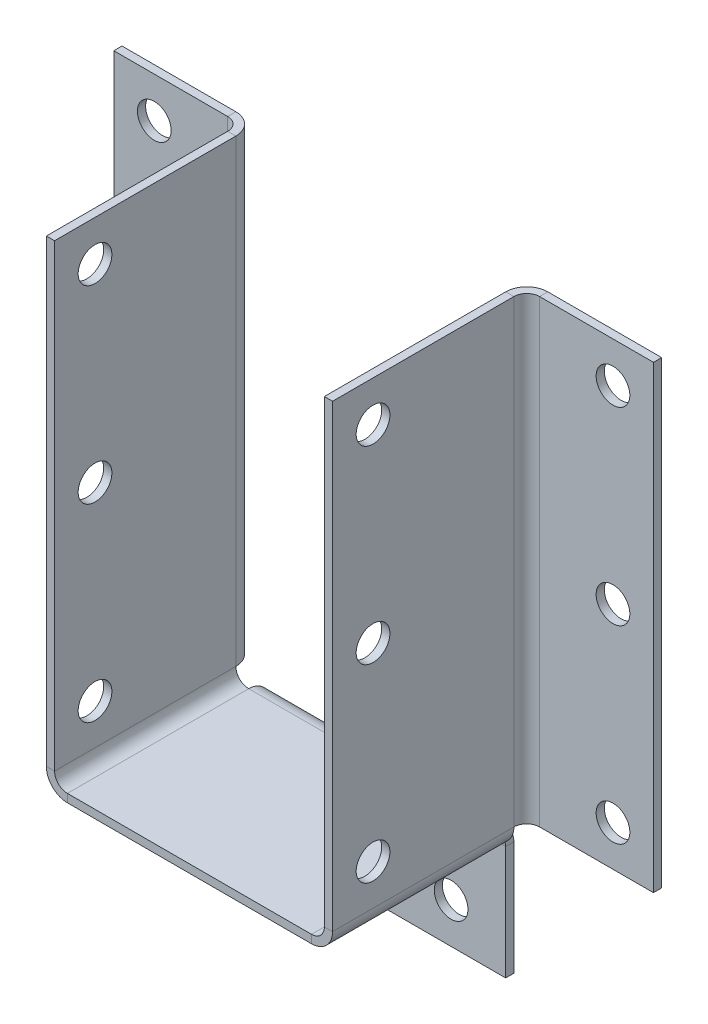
ISO-10303-21;
HEADER;
FILE_DESCRIPTION(('STEP AP214'),'2;1');
FILE_NAME('part.step','',(''),(''),'','','');
FILE_SCHEMA(('AUTOMOTIVE_DESIGN { 1 0 10303 214 1 1 1 1 }'));
ENDSEC;
DATA;
#1=APPLICATION_CONTEXT('core data for automotive mechanical design processes');
#2=APPLICATION_PROTOCOL_DEFINITION('international standard','automotive_design',2000,#1);
#3=PRODUCT_CONTEXT('',#1,'mechanical');
#4=PRODUCT('Part','Part','',(#3));
#5=PRODUCT_RELATED_PRODUCT_CATEGORY('part','',(#4));
#6=PRODUCT_DEFINITION_FORMATION('','',#4);
#7=PRODUCT_DEFINITION_CONTEXT('part definition',#1,'design');
#8=PRODUCT_DEFINITION('design','',#6,#7);
#9=PRODUCT_DEFINITION_SHAPE('','',#8);
#10=(LENGTH_UNIT() NAMED_UNIT(*) SI_UNIT(.MILLI.,.METRE.));
#11=(NAMED_UNIT(*) PLANE_ANGLE_UNIT() SI_UNIT($,.RADIAN.));
#12=(NAMED_UNIT(*) SI_UNIT($,.STERADIAN.) SOLID_ANGLE_UNIT());
#13=UNCERTAINTY_MEASURE_WITH_UNIT(LENGTH_MEASURE(1.E-05),#10,'distance_accuracy_value','');
#14=(GEOMETRIC_REPRESENTATION_CONTEXT(3) GLOBAL_UNCERTAINTY_ASSIGNED_CONTEXT((#13)) GLOBAL_UNIT_ASSIGNED_CONTEXT((#10,
#11,#12)) REPRESENTATION_CONTEXT('',''));
#15=CARTESIAN_POINT('',(0.,0.,0.));
#16=DIRECTION('',(0.,0.,1.));
#17=DIRECTION('',(1.,0.,0.));
#18=AXIS2_PLACEMENT_3D('',#15,#16,#17);
#19=CARTESIAN_POINT('',(-20.,70.,30.));
#20=DIRECTION('',(-1.,0.,0.));
#21=DIRECTION('',(0.,-1.,0.));
#22=AXIS2_PLACEMENT_3D('',#19,#20,#21);
#23=PLANE('',#22);
#24=CARTESIAN_POINT('',(-20.,35.9525,24.));
#25=DIRECTION('',(-1.,0.,0.));
#26=DIRECTION('',(0.,-1.,0.));
#27=AXIS2_PLACEMENT_3D('',#24,#25,#26);
#28=CIRCLE('',#27,2.49999999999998);
#29=CARTESIAN_POINT('',(-20.,33.4525,24.));
#30=VERTEX_POINT('',#29);
#31=EDGE_CURVE('E527',#30,#30,#28,.T.);
#32=ORIENTED_EDGE('',*,*,#31,.T.);
#33=EDGE_LOOP('',(#32));
#34=FACE_BOUND('',#33,.T.);
#35=CARTESIAN_POINT('',(-20.,64.,24.));
#36=DIRECTION('',(-1.,0.,0.));
#37=DIRECTION('',(0.,-1.,0.));
#38=AXIS2_PLACEMENT_3D('',#35,#36,#37);
#39=CIRCLE('',#38,2.49999999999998);
#40=CARTESIAN_POINT('',(-20.,61.5,24.));
#41=VERTEX_POINT('',#40);
#42=EDGE_CURVE('E519',#41,#41,#39,.T.);
#43=ORIENTED_EDGE('',*,*,#42,.T.);
#44=EDGE_LOOP('',(#43));
#45=FACE_BOUND('',#44,.T.);
#46=CARTESIAN_POINT('',(-20.,7.905,24.));
#47=DIRECTION('',(-1.,0.,0.));
#48=DIRECTION('',(0.,-1.,0.));
#49=AXIS2_PLACEMENT_3D('',#46,#47,#48);
#50=CIRCLE('',#49,2.49999999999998);
#51=CARTESIAN_POINT('',(-20.,5.40500000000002,24.));
#52=VERTEX_POINT('',#51);
#53=EDGE_CURVE('E539',#52,#52,#50,.T.);
#54=ORIENTED_EDGE('',*,*,#53,.T.);
#55=EDGE_LOOP('',(#54));
#56=FACE_BOUND('',#55,.T.);
#57=DIRECTION('',(0.,-1.,0.));
#58=VECTOR('',#57,1.);
#59=CARTESIAN_POINT('',(-20.,1.905,3.11911999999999));
#60=LINE('',#59,#58);
#61=CARTESIAN_POINT('',(-20.,1.905,3.11911999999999));
#62=VERTEX_POINT('',#61);
#63=CARTESIAN_POINT('',(-20.,70.,3.11911999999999));
#64=VERTEX_POINT('',#63);
#65=EDGE_CURVE('E307',#62,#64,#60,.F.);
#66=ORIENTED_EDGE('',*,*,#65,.T.);
#67=DIRECTION('',(0.,0.,-1.));
#68=VECTOR('',#67,1.);
#69=CARTESIAN_POINT('',(-20.,70.,30.));
#70=LINE('',#69,#68);
#71=CARTESIAN_POINT('',(-20.,70.,30.));
#72=VERTEX_POINT('',#71);
#73=EDGE_CURVE('E497',#72,#64,#70,.T.);
#74=ORIENTED_EDGE('',*,*,#73,.F.);
#75=DIRECTION('',(0.,1.,0.));
#76=VECTOR('',#75,1.);
#77=CARTESIAN_POINT('',(-20.,70.,30.));
#78=LINE('',#77,#76);
#79=CARTESIAN_POINT('',(-20.,1.905,30.));
#80=VERTEX_POINT('',#79);
#81=EDGE_CURVE('E430',#80,#72,#78,.T.);
#82=ORIENTED_EDGE('',*,*,#81,.F.);
#83=DIRECTION('',(0.,0.,-1.));
#84=VECTOR('',#83,1.);
#85=CARTESIAN_POINT('',(-20.,1.905,30.));
#86=LINE('',#85,#84);
#87=EDGE_CURVE('E467',#80,#62,#86,.T.);
#88=ORIENTED_EDGE('',*,*,#87,.T.);
#89=EDGE_LOOP('',(#66,#74,#82,#88));
#90=FACE_BOUND('',#89,.T.);
#91=ADVANCED_FACE('F100',(#34,#45,#56,#90),#23,.F.);
#92=CARTESIAN_POINT('',(-21.21412,70.,30.));
#93=DIRECTION('',(-1.,0.,0.));
#94=DIRECTION('',(0.,-1.,0.));
#95=AXIS2_PLACEMENT_3D('',#92,#93,#94);
#96=PLANE('',#95);
#97=CARTESIAN_POINT('',(-21.21412,35.9525,24.));
#98=DIRECTION('',(-1.,0.,0.));
#99=DIRECTION('',(0.,-1.,0.));
#100=AXIS2_PLACEMENT_3D('',#97,#98,#99);
#101=CIRCLE('',#100,2.49999999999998);
#102=CARTESIAN_POINT('',(-21.21412,33.4525,24.));
#103=VERTEX_POINT('',#102);
#104=EDGE_CURVE('E522',#103,#103,#101,.T.);
#105=ORIENTED_EDGE('',*,*,#104,.F.);
#106=EDGE_LOOP('',(#105));
#107=FACE_BOUND('',#106,.T.);
#108=CARTESIAN_POINT('',(-21.21412,64.,24.));
#109=DIRECTION('',(-1.,0.,0.));
#110=DIRECTION('',(0.,-1.,0.));
#111=AXIS2_PLACEMENT_3D('',#108,#109,#110);
#112=CIRCLE('',#111,2.49999999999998);
#113=CARTESIAN_POINT('',(-21.21412,61.5,24.));
#114=VERTEX_POINT('',#113);
#115=EDGE_CURVE('E514',#114,#114,#112,.T.);
#116=ORIENTED_EDGE('',*,*,#115,.F.);
#117=EDGE_LOOP('',(#116));
#118=FACE_BOUND('',#117,.T.);
#119=CARTESIAN_POINT('',(-21.21412,7.905,24.));
#120=DIRECTION('',(-1.,0.,0.));
#121=DIRECTION('',(0.,-1.,0.));
#122=AXIS2_PLACEMENT_3D('',#119,#120,#121);
#123=CIRCLE('',#122,2.49999999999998);
#124=CARTESIAN_POINT('',(-21.21412,5.40500000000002,24.));
#125=VERTEX_POINT('',#124);
#126=EDGE_CURVE('E542',#125,#125,#123,.T.);
#127=ORIENTED_EDGE('',*,*,#126,.F.);
#128=EDGE_LOOP('',(#127));
#129=FACE_BOUND('',#128,.T.);
#130=DIRECTION('',(0.,0.,-1.));
#131=VECTOR('',#130,1.);
#132=CARTESIAN_POINT('',(-21.21412,70.,30.));
#133=LINE('',#132,#131);
#134=CARTESIAN_POINT('',(-21.21412,70.,30.));
#135=VERTEX_POINT('',#134);
#136=CARTESIAN_POINT('',(-21.21412,70.,3.11911999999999));
#137=VERTEX_POINT('',#136);
#138=EDGE_CURVE('E494',#135,#137,#133,.T.);
#139=ORIENTED_EDGE('',*,*,#138,.T.);
#140=DIRECTION('',(0.,-1.,0.));
#141=VECTOR('',#140,1.);
#142=CARTESIAN_POINT('',(-21.21412,1.905,3.11911999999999));
#143=LINE('',#142,#141);
#144=CARTESIAN_POINT('',(-21.21412,1.90500000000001,3.11911999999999));
#145=VERTEX_POINT('',#144);
#146=EDGE_CURVE('E318',#145,#137,#143,.F.);
#147=ORIENTED_EDGE('',*,*,#146,.F.);
#148=DIRECTION('',(0.,0.,-1.));
#149=VECTOR('',#148,1.);
#150=CARTESIAN_POINT('',(-21.21412,1.905,30.));
#151=LINE('',#150,#149);
#152=CARTESIAN_POINT('',(-21.21412,1.905,30.));
#153=VERTEX_POINT('',#152);
#154=EDGE_CURVE('E491',#153,#145,#151,.T.);
#155=ORIENTED_EDGE('',*,*,#154,.F.);
#156=DIRECTION('',(0.,1.,0.));
#157=VECTOR('',#156,1.);
#158=CARTESIAN_POINT('',(-21.21412,70.,30.));
#159=LINE('',#158,#157);
#160=EDGE_CURVE('E437',#153,#135,#159,.T.);
#161=ORIENTED_EDGE('',*,*,#160,.T.);
#162=EDGE_LOOP('',(#139,#147,#155,#161));
#163=FACE_BOUND('',#162,.T.);
#164=ADVANCED_FACE('F694',(#107,#118,#129,#163),#96,.T.);
#165=CARTESIAN_POINT('',(-18.095,1.905,30.));
#166=DIRECTION('',(0.,0.,-1.));
#167=DIRECTION('',(-1.,0.,0.));
#168=AXIS2_PLACEMENT_3D('',#165,#166,#167);
#169=CYLINDRICAL_SURFACE('',#168,3.11912);
#170=ORIENTED_EDGE('',*,*,#154,.T.);
#171=CARTESIAN_POINT('',(-18.095,1.905,3.11911999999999));
#172=DIRECTION('',(0.,0.,-1.));
#173=DIRECTION('',(-1.,0.,0.));
#174=AXIS2_PLACEMENT_3D('',#171,#172,#173);
#175=CIRCLE('',#174,3.11912);
#176=CARTESIAN_POINT('',(-18.095,-1.21412,3.11911999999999));
#177=VERTEX_POINT('',#176);
#178=EDGE_CURVE('E109',#145,#177,#175,.F.);
#179=ORIENTED_EDGE('',*,*,#178,.T.);
#180=DIRECTION('',(0.,0.,-1.));
#181=VECTOR('',#180,1.);
#182=CARTESIAN_POINT('',(-18.095,-1.21412,30.));
#183=LINE('',#182,#181);
#184=CARTESIAN_POINT('',(-18.095,-1.21412,30.));
#185=VERTEX_POINT('',#184);
#186=EDGE_CURVE('E488',#185,#177,#183,.T.);
#187=ORIENTED_EDGE('',*,*,#186,.F.);
#188=CARTESIAN_POINT('',(-18.095,1.905,30.));
#189=DIRECTION('',(0.,0.,1.));
#190=DIRECTION('',(1.,0.,0.));
#191=AXIS2_PLACEMENT_3D('',#188,#189,#190);
#192=CIRCLE('',#191,3.11912);
#193=EDGE_CURVE('E440',#185,#153,#192,.F.);
#194=ORIENTED_EDGE('',*,*,#193,.T.);
#195=EDGE_LOOP('',(#170,#179,#187,#194));
#196=FACE_BOUND('',#195,.T.);
#197=ADVANCED_FACE('F700',(#196),#169,.T.);
#198=CARTESIAN_POINT('',(-20.,-1.21412,30.));
#199=DIRECTION('',(0.,-1.,0.));
#200=DIRECTION('',(0.,0.,-1.));
#201=AXIS2_PLACEMENT_3D('',#198,#199,#200);
#202=PLANE('',#201);
#203=ORIENTED_EDGE('',*,*,#186,.T.);
#204=DIRECTION('',(1.,0.,0.));
#205=VECTOR('',#204,1.);
#206=CARTESIAN_POINT('',(18.095,-1.21412000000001,3.11911999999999));
#207=LINE('',#206,#205);
#208=CARTESIAN_POINT('',(18.095,-1.21412000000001,3.11911999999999));
#209=VERTEX_POINT('',#208);
#210=EDGE_CURVE('E370',#209,#177,#207,.F.);
#211=ORIENTED_EDGE('',*,*,#210,.F.);
#212=DIRECTION('',(0.,0.,-1.));
#213=VECTOR('',#212,1.);
#214=CARTESIAN_POINT('',(18.095,-1.21412,30.));
#215=LINE('',#214,#213);
#216=CARTESIAN_POINT('',(18.095,-1.21412,30.));
#217=VERTEX_POINT('',#216);
#218=EDGE_CURVE('E486',#217,#209,#215,.T.);
#219=ORIENTED_EDGE('',*,*,#218,.F.);
#220=DIRECTION('',(1.,0.,0.));
#221=VECTOR('',#220,1.);
#222=CARTESIAN_POINT('',(-20.,-1.21412,30.));
#223=LINE('',#222,#221);
#224=EDGE_CURVE('E443',#217,#185,#223,.F.);
#225=ORIENTED_EDGE('',*,*,#224,.T.);
#226=EDGE_LOOP('',(#203,#211,#219,#225));
#227=FACE_BOUND('',#226,.T.);
#228=ADVANCED_FACE('F739',(#227),#202,.T.);
#229=CARTESIAN_POINT('',(-20.,0.,30.));
#230=DIRECTION('',(0.,-1.,0.));
#231=DIRECTION('',(0.,0.,-1.));
#232=AXIS2_PLACEMENT_3D('',#229,#230,#231);
#233=PLANE('',#232);
#234=DIRECTION('',(1.,0.,0.));
#235=VECTOR('',#234,1.);
#236=CARTESIAN_POINT('',(18.095,0.,3.11911999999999));
#237=LINE('',#236,#235);
#238=CARTESIAN_POINT('',(18.095,0.,3.11911999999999));
#239=VERTEX_POINT('',#238);
#240=CARTESIAN_POINT('',(-18.095,0.,3.11911999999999));
#241=VERTEX_POINT('',#240);
#242=EDGE_CURVE('E358',#239,#241,#237,.F.);
#243=ORIENTED_EDGE('',*,*,#242,.T.);
#244=DIRECTION('',(0.,0.,-1.));
#245=VECTOR('',#244,1.);
#246=CARTESIAN_POINT('',(-18.095,0.,30.));
#247=LINE('',#246,#245);
#248=CARTESIAN_POINT('',(-18.095,0.,30.));
#249=VERTEX_POINT('',#248);
#250=EDGE_CURVE('E470',#249,#241,#247,.T.);
#251=ORIENTED_EDGE('',*,*,#250,.F.);
#252=DIRECTION('',(-1.,0.,0.));
#253=VECTOR('',#252,1.);
#254=CARTESIAN_POINT('',(-20.,0.,30.));
#255=LINE('',#254,#253);
#256=CARTESIAN_POINT('',(18.095,0.,30.));
#257=VERTEX_POINT('',#256);
#258=EDGE_CURVE('E461',#257,#249,#255,.T.);
#259=ORIENTED_EDGE('',*,*,#258,.F.);
#260=DIRECTION('',(0.,0.,-1.));
#261=VECTOR('',#260,1.);
#262=CARTESIAN_POINT('',(18.095,0.,30.));
#263=LINE('',#262,#261);
#264=EDGE_CURVE('E473',#257,#239,#263,.T.);
#265=ORIENTED_EDGE('',*,*,#264,.T.);
#266=EDGE_LOOP('',(#243,#251,#259,#265));
#267=FACE_BOUND('',#266,.T.);
#268=ADVANCED_FACE('F630',(#267),#233,.F.);
#269=CARTESIAN_POINT('',(18.095,1.905,30.));
#270=DIRECTION('',(0.,0.,-1.));
#271=DIRECTION('',(-1.,0.,0.));
#272=AXIS2_PLACEMENT_3D('',#269,#270,#271);
#273=CYLINDRICAL_SURFACE('',#272,3.11912);
#274=ORIENTED_EDGE('',*,*,#218,.T.);
#275=CARTESIAN_POINT('',(18.095,1.905,3.11911999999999));
#276=DIRECTION('',(0.,0.,-1.));
#277=DIRECTION('',(-1.,0.,0.));
#278=AXIS2_PLACEMENT_3D('',#275,#276,#277);
#279=CIRCLE('',#278,3.11912);
#280=CARTESIAN_POINT('',(21.21412,1.90500000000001,3.11911999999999));
#281=VERTEX_POINT('',#280);
#282=EDGE_CURVE('E125',#209,#281,#279,.F.);
#283=ORIENTED_EDGE('',*,*,#282,.T.);
#284=DIRECTION('',(0.,0.,-1.));
#285=VECTOR('',#284,1.);
#286=CARTESIAN_POINT('',(21.21412,1.90500000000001,30.));
#287=LINE('',#286,#285);
#288=CARTESIAN_POINT('',(21.21412,1.90500000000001,30.));
#289=VERTEX_POINT('',#288);
#290=EDGE_CURVE('E484',#289,#281,#287,.T.);
#291=ORIENTED_EDGE('',*,*,#290,.F.);
#292=CARTESIAN_POINT('',(18.095,1.905,30.));
#293=DIRECTION('',(0.,0.,1.));
#294=DIRECTION('',(1.,0.,0.));
#295=AXIS2_PLACEMENT_3D('',#292,#293,#294);
#296=CIRCLE('',#295,3.11912);
#297=EDGE_CURVE('E446',#289,#217,#296,.F.);
#298=ORIENTED_EDGE('',*,*,#297,.T.);
#299=EDGE_LOOP('',(#274,#283,#291,#298));
#300=FACE_BOUND('',#299,.T.);
#301=ADVANCED_FACE('F742',(#300),#273,.T.);
#302=CARTESIAN_POINT('',(21.21412,70.,30.));
#303=DIRECTION('',(1.,0.,0.));
#304=DIRECTION('',(0.,1.,0.));
#305=AXIS2_PLACEMENT_3D('',#302,#303,#304);
#306=PLANE('',#305);
#307=CARTESIAN_POINT('',(21.21412,35.9525,24.));
#308=DIRECTION('',(1.,0.,0.));
#309=DIRECTION('',(0.,0.,-1.));
#310=AXIS2_PLACEMENT_3D('',#307,#308,#309);
#311=CIRCLE('',#310,2.49999999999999);
#312=CARTESIAN_POINT('',(21.21412,35.9525,21.5));
#313=VERTEX_POINT('',#312);
#314=EDGE_CURVE('E1309',#313,#313,#311,.T.);
#315=ORIENTED_EDGE('',*,*,#314,.F.);
#316=EDGE_LOOP('',(#315));
#317=FACE_BOUND('',#316,.T.);
#318=CARTESIAN_POINT('',(21.21412,64.,24.));
#319=DIRECTION('',(1.,0.,0.));
#320=DIRECTION('',(0.,0.,-1.));
#321=AXIS2_PLACEMENT_3D('',#318,#319,#320);
#322=CIRCLE('',#321,2.49999999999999);
#323=CARTESIAN_POINT('',(21.21412,64.,21.5));
#324=VERTEX_POINT('',#323);
#325=EDGE_CURVE('E515',#324,#324,#322,.T.);
#326=ORIENTED_EDGE('',*,*,#325,.F.);
#327=EDGE_LOOP('',(#326));
#328=FACE_BOUND('',#327,.T.);
#329=CARTESIAN_POINT('',(21.21412,7.905,24.));
#330=DIRECTION('',(1.,0.,0.));
#331=DIRECTION('',(0.,0.,-1.));
#332=AXIS2_PLACEMENT_3D('',#329,#330,#331);
#333=CIRCLE('',#332,2.49999999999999);
#334=CARTESIAN_POINT('',(21.21412,7.905,21.5));
#335=VERTEX_POINT('',#334);
#336=EDGE_CURVE('E533',#335,#335,#333,.T.);
#337=ORIENTED_EDGE('',*,*,#336,.F.);
#338=EDGE_LOOP('',(#337));
#339=FACE_BOUND('',#338,.T.);
#340=ORIENTED_EDGE('',*,*,#290,.T.);
#341=DIRECTION('',(0.,1.,0.));
#342=VECTOR('',#341,1.);
#343=CARTESIAN_POINT('',(21.21412,70.,3.11911999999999));
#344=LINE('',#343,#342);
#345=CARTESIAN_POINT('',(21.21412,70.,3.11911999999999));
#346=VERTEX_POINT('',#345);
#347=EDGE_CURVE('E422',#346,#281,#344,.F.);
#348=ORIENTED_EDGE('',*,*,#347,.F.);
#349=DIRECTION('',(0.,0.,-1.));
#350=VECTOR('',#349,1.);
#351=CARTESIAN_POINT('',(21.21412,70.,30.));
#352=LINE('',#351,#350);
#353=CARTESIAN_POINT('',(21.21412,70.,30.));
#354=VERTEX_POINT('',#353);
#355=EDGE_CURVE('E481',#354,#346,#352,.T.);
#356=ORIENTED_EDGE('',*,*,#355,.F.);
#357=DIRECTION('',(0.,-1.,0.));
#358=VECTOR('',#357,1.);
#359=CARTESIAN_POINT('',(21.21412,70.,30.));
#360=LINE('',#359,#358);
#361=EDGE_CURVE('E449',#354,#289,#360,.T.);
#362=ORIENTED_EDGE('',*,*,#361,.T.);
#363=EDGE_LOOP('',(#340,#348,#356,#362));
#364=FACE_BOUND('',#363,.T.);
#365=ADVANCED_FACE('F745',(#317,#328,#339,#364),#306,.T.);
#366=CARTESIAN_POINT('',(20.,70.,30.));
#367=DIRECTION('',(0.,1.,0.));
#368=DIRECTION('',(0.,0.,1.));
#369=AXIS2_PLACEMENT_3D('',#366,#367,#368);
#370=PLANE('',#369);
#371=ORIENTED_EDGE('',*,*,#355,.T.);
#372=DIRECTION('',(-1.,0.,0.));
#373=VECTOR('',#372,1.);
#374=CARTESIAN_POINT('',(21.21412,70.,3.11911999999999));
#375=LINE('',#374,#373);
#376=CARTESIAN_POINT('',(20.,70.,3.11911999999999));
#377=VERTEX_POINT('',#376);
#378=EDGE_CURVE('E416',#346,#377,#375,.T.);
#379=ORIENTED_EDGE('',*,*,#378,.T.);
#380=DIRECTION('',(0.,0.,-1.));
#381=VECTOR('',#380,1.);
#382=CARTESIAN_POINT('',(20.,70.,30.));
#383=LINE('',#382,#381);
#384=CARTESIAN_POINT('',(20.,70.,30.));
#385=VERTEX_POINT('',#384);
#386=EDGE_CURVE('E479',#385,#377,#383,.T.);
#387=ORIENTED_EDGE('',*,*,#386,.F.);
#388=DIRECTION('',(1.,0.,0.));
#389=VECTOR('',#388,1.);
#390=CARTESIAN_POINT('',(20.,70.,30.));
#391=LINE('',#390,#389);
#392=EDGE_CURVE('E452',#385,#354,#391,.T.);
#393=ORIENTED_EDGE('',*,*,#392,.T.);
#394=EDGE_LOOP('',(#371,#379,#387,#393));
#395=FACE_BOUND('',#394,.T.);
#396=ADVANCED_FACE('F748',(#395),#370,.T.);
#397=CARTESIAN_POINT('',(20.,70.,30.));
#398=DIRECTION('',(1.,0.,0.));
#399=DIRECTION('',(0.,1.,0.));
#400=AXIS2_PLACEMENT_3D('',#397,#398,#399);
#401=PLANE('',#400);
#402=CARTESIAN_POINT('',(20.,35.9525,24.));
#403=DIRECTION('',(1.,0.,0.));
#404=DIRECTION('',(0.,1.,0.));
#405=AXIS2_PLACEMENT_3D('',#402,#403,#404);
#406=CIRCLE('',#405,2.49999999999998);
#407=CARTESIAN_POINT('',(20.,38.4525,24.));
#408=VERTEX_POINT('',#407);
#409=EDGE_CURVE('E104',#408,#408,#406,.T.);
#410=ORIENTED_EDGE('',*,*,#409,.T.);
#411=EDGE_LOOP('',(#410));
#412=FACE_BOUND('',#411,.T.);
#413=CARTESIAN_POINT('',(20.,64.,24.));
#414=DIRECTION('',(1.,0.,0.));
#415=DIRECTION('',(0.,1.,0.));
#416=AXIS2_PLACEMENT_3D('',#413,#414,#415);
#417=CIRCLE('',#416,2.49999999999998);
#418=CARTESIAN_POINT('',(20.,66.5,24.));
#419=VERTEX_POINT('',#418);
#420=EDGE_CURVE('E512',#419,#419,#417,.T.);
#421=ORIENTED_EDGE('',*,*,#420,.T.);
#422=EDGE_LOOP('',(#421));
#423=FACE_BOUND('',#422,.T.);
#424=CARTESIAN_POINT('',(20.,7.905,24.));
#425=DIRECTION('',(1.,0.,0.));
#426=DIRECTION('',(0.,1.,0.));
#427=AXIS2_PLACEMENT_3D('',#424,#425,#426);
#428=CIRCLE('',#427,2.49999999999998);
#429=CARTESIAN_POINT('',(20.,10.405,24.));
#430=VERTEX_POINT('',#429);
#431=EDGE_CURVE('E536',#430,#430,#428,.T.);
#432=ORIENTED_EDGE('',*,*,#431,.T.);
#433=EDGE_LOOP('',(#432));
#434=FACE_BOUND('',#433,.T.);
#435=DIRECTION('',(0.,1.,0.));
#436=VECTOR('',#435,1.);
#437=CARTESIAN_POINT('',(20.,70.,3.11911999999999));
#438=LINE('',#437,#436);
#439=CARTESIAN_POINT('',(20.,1.905,3.11911999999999));
#440=VERTEX_POINT('',#439);
#441=EDGE_CURVE('E409',#377,#440,#438,.F.);
#442=ORIENTED_EDGE('',*,*,#441,.T.);
#443=DIRECTION('',(0.,0.,-1.));
#444=VECTOR('',#443,1.);
#445=CARTESIAN_POINT('',(20.,1.905,30.));
#446=LINE('',#445,#444);
#447=CARTESIAN_POINT('',(20.,1.905,30.));
#448=VERTEX_POINT('',#447);
#449=EDGE_CURVE('E476',#448,#440,#446,.T.);
#450=ORIENTED_EDGE('',*,*,#449,.F.);
#451=DIRECTION('',(0.,-1.,0.));
#452=VECTOR('',#451,1.);
#453=CARTESIAN_POINT('',(20.,70.,30.));
#454=LINE('',#453,#452);
#455=EDGE_CURVE('E455',#385,#448,#454,.T.);
#456=ORIENTED_EDGE('',*,*,#455,.F.);
#457=ORIENTED_EDGE('',*,*,#386,.T.);
#458=EDGE_LOOP('',(#442,#450,#456,#457));
#459=FACE_BOUND('',#458,.T.);
#460=ADVANCED_FACE('F719',(#412,#423,#434,#459),#401,.F.);
#461=CARTESIAN_POINT('',(-18.095,0.,30.));
#462=DIRECTION('',(0.,0.,1.));
#463=DIRECTION('',(1.,0.,0.));
#464=AXIS2_PLACEMENT_3D('',#461,#462,#463);
#465=PLANE('',#464);
#466=DIRECTION('',(0.,-1.,0.));
#467=VECTOR('',#466,1.);
#468=CARTESIAN_POINT('',(-18.095,0.,30.));
#469=LINE('',#468,#467);
#470=EDGE_CURVE('E506',#249,#185,#469,.T.);
#471=ORIENTED_EDGE('',*,*,#470,.F.);
#472=CARTESIAN_POINT('',(-18.095,1.905,30.));
#473=DIRECTION('',(0.,0.,-1.));
#474=DIRECTION('',(-1.,0.,0.));
#475=AXIS2_PLACEMENT_3D('',#472,#473,#474);
#476=CIRCLE('',#475,1.905);
#477=EDGE_CURVE('E464',#249,#80,#476,.T.);
#478=ORIENTED_EDGE('',*,*,#477,.T.);
#479=DIRECTION('',(1.,0.,0.));
#480=VECTOR('',#479,1.);
#481=CARTESIAN_POINT('',(-21.21412,1.905,30.));
#482=LINE('',#481,#480);
#483=EDGE_CURVE('E504',#153,#80,#482,.T.);
#484=ORIENTED_EDGE('',*,*,#483,.F.);
#485=ORIENTED_EDGE('',*,*,#193,.F.);
#486=EDGE_LOOP('',(#471,#478,#484,#485));
#487=FACE_BOUND('',#486,.T.);
#488=ADVANCED_FACE('F623',(#487),#465,.T.);
#489=CARTESIAN_POINT('',(-21.21412,1.905,30.));
#490=DIRECTION('',(0.,0.,1.));
#491=DIRECTION('',(1.,0.,0.));
#492=AXIS2_PLACEMENT_3D('',#489,#490,#491);
#493=PLANE('',#492);
#494=ORIENTED_EDGE('',*,*,#258,.T.);
#495=ORIENTED_EDGE('',*,*,#470,.T.);
#496=ORIENTED_EDGE('',*,*,#224,.F.);
#497=DIRECTION('',(0.,1.,0.));
#498=VECTOR('',#497,1.);
#499=CARTESIAN_POINT('',(18.095,-1.21412,30.));
#500=LINE('',#499,#498);
#501=EDGE_CURVE('E500',#217,#257,#500,.T.);
#502=ORIENTED_EDGE('',*,*,#501,.T.);
#503=EDGE_LOOP('',(#494,#495,#496,#502));
#504=FACE_BOUND('',#503,.T.);
#505=ADVANCED_FACE('F628',(#504),#493,.T.);
#506=CARTESIAN_POINT('',(20.,1.905,30.));
#507=DIRECTION('',(0.,0.,1.));
#508=DIRECTION('',(1.,0.,0.));
#509=AXIS2_PLACEMENT_3D('',#506,#507,#508);
#510=PLANE('',#509);
#511=DIRECTION('',(1.,0.,0.));
#512=VECTOR('',#511,1.);
#513=CARTESIAN_POINT('',(20.,1.905,30.));
#514=LINE('',#513,#512);
#515=EDGE_CURVE('E502',#448,#289,#514,.T.);
#516=ORIENTED_EDGE('',*,*,#515,.F.);
#517=CARTESIAN_POINT('',(18.095,1.905,30.));
#518=DIRECTION('',(0.,0.,-1.));
#519=DIRECTION('',(-1.,0.,0.));
#520=AXIS2_PLACEMENT_3D('',#517,#518,#519);
#521=CIRCLE('',#520,1.905);
#522=EDGE_CURVE('E458',#448,#257,#521,.T.);
#523=ORIENTED_EDGE('',*,*,#522,.T.);
#524=ORIENTED_EDGE('',*,*,#501,.F.);
#525=ORIENTED_EDGE('',*,*,#297,.F.);
#526=EDGE_LOOP('',(#516,#523,#524,#525));
#527=FACE_BOUND('',#526,.T.);
#528=ADVANCED_FACE('F711',(#527),#510,.T.);
#529=CARTESIAN_POINT('',(18.095,-1.21412,30.));
#530=DIRECTION('',(0.,0.,1.));
#531=DIRECTION('',(1.,0.,0.));
#532=AXIS2_PLACEMENT_3D('',#529,#530,#531);
#533=PLANE('',#532);
#534=ORIENTED_EDGE('',*,*,#455,.T.);
#535=ORIENTED_EDGE('',*,*,#515,.T.);
#536=ORIENTED_EDGE('',*,*,#361,.F.);
#537=ORIENTED_EDGE('',*,*,#392,.F.);
#538=EDGE_LOOP('',(#534,#535,#536,#537));
#539=FACE_BOUND('',#538,.T.);
#540=ADVANCED_FACE('F708',(#539),#533,.T.);
#541=CARTESIAN_POINT('',(-21.21412,70.,30.));
#542=DIRECTION('',(0.,1.,0.));
#543=DIRECTION('',(0.,0.,1.));
#544=AXIS2_PLACEMENT_3D('',#541,#542,#543);
#545=PLANE('',#544);
#546=DIRECTION('',(1.,0.,0.));
#547=VECTOR('',#546,1.);
#548=CARTESIAN_POINT('',(-21.21412,70.,3.11911999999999));
#549=LINE('',#548,#547);
#550=EDGE_CURVE('E323',#137,#64,#549,.T.);
#551=ORIENTED_EDGE('',*,*,#550,.F.);
#552=ORIENTED_EDGE('',*,*,#138,.F.);
#553=DIRECTION('',(1.,0.,0.));
#554=VECTOR('',#553,1.);
#555=CARTESIAN_POINT('',(-21.21412,70.,30.));
#556=LINE('',#555,#554);
#557=EDGE_CURVE('E434',#135,#72,#556,.T.);
#558=ORIENTED_EDGE('',*,*,#557,.T.);
#559=ORIENTED_EDGE('',*,*,#73,.T.);
#560=EDGE_LOOP('',(#551,#552,#558,#559));
#561=FACE_BOUND('',#560,.T.);
#562=ADVANCED_FACE('F707',(#561),#545,.T.);
#563=CARTESIAN_POINT('',(-18.095,1.905,3.11911999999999));
#564=DIRECTION('',(0.,0.,-1.));
#565=DIRECTION('',(-1.,0.,0.));
#566=AXIS2_PLACEMENT_3D('',#563,#564,#565);
#567=PLANE('',#566);
#568=ORIENTED_EDGE('',*,*,#178,.F.);
#569=DIRECTION('',(1.,0.,0.));
#570=VECTOR('',#569,1.);
#571=CARTESIAN_POINT('',(-21.21412,1.90500000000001,3.11911999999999));
#572=LINE('',#571,#570);
#573=EDGE_CURVE('E313',#145,#62,#572,.T.);
#574=ORIENTED_EDGE('',*,*,#573,.T.);
#575=CARTESIAN_POINT('',(-18.095,1.905,3.11911999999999));
#576=DIRECTION('',(0.,0.,-1.));
#577=DIRECTION('',(-1.,0.,0.));
#578=AXIS2_PLACEMENT_3D('',#575,#576,#577);
#579=CIRCLE('',#578,1.905);
#580=EDGE_CURVE('E13',#62,#241,#579,.F.);
#581=ORIENTED_EDGE('',*,*,#580,.T.);
#582=DIRECTION('',(0.,1.,0.));
#583=VECTOR('',#582,1.);
#584=CARTESIAN_POINT('',(-18.095,-1.21412,3.11911999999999));
#585=LINE('',#584,#583);
#586=EDGE_CURVE('E374',#177,#241,#585,.T.);
#587=ORIENTED_EDGE('',*,*,#586,.F.);
#588=EDGE_LOOP('',(#568,#574,#581,#587));
#589=FACE_BOUND('',#588,.T.);
#590=ADVANCED_FACE('F102',(#589),#567,.T.);
#591=CARTESIAN_POINT('',(18.095,1.905,3.11911999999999));
#592=DIRECTION('',(0.,0.,-1.));
#593=DIRECTION('',(-1.,0.,0.));
#594=AXIS2_PLACEMENT_3D('',#591,#592,#593);
#595=PLANE('',#594);
#596=ORIENTED_EDGE('',*,*,#282,.F.);
#597=DIRECTION('',(0.,1.,0.));
#598=VECTOR('',#597,1.);
#599=CARTESIAN_POINT('',(18.095,-1.21412000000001,3.11911999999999));
#600=LINE('',#599,#598);
#601=EDGE_CURVE('E365',#209,#239,#600,.T.);
#602=ORIENTED_EDGE('',*,*,#601,.T.);
#603=CARTESIAN_POINT('',(18.095,1.905,3.11911999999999));
#604=DIRECTION('',(0.,0.,-1.));
#605=DIRECTION('',(-1.,0.,0.));
#606=AXIS2_PLACEMENT_3D('',#603,#604,#605);
#607=CIRCLE('',#606,1.905);
#608=EDGE_CURVE('E509',#239,#440,#607,.F.);
#609=ORIENTED_EDGE('',*,*,#608,.T.);
#610=DIRECTION('',(-1.,0.,0.));
#611=VECTOR('',#610,1.);
#612=CARTESIAN_POINT('',(21.21412,1.905,3.11911999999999));
#613=LINE('',#612,#611);
#614=EDGE_CURVE('E427',#281,#440,#613,.T.);
#615=ORIENTED_EDGE('',*,*,#614,.F.);
#616=EDGE_LOOP('',(#596,#602,#609,#615));
#617=FACE_BOUND('',#616,.T.);
#618=ADVANCED_FACE('F638',(#617),#595,.T.);
#619=CARTESIAN_POINT('',(18.095,1.905,30.));
#620=DIRECTION('',(0.,0.,-1.));
#621=DIRECTION('',(-1.,0.,0.));
#622=AXIS2_PLACEMENT_3D('',#619,#620,#621);
#623=CYLINDRICAL_SURFACE('',#622,1.905);
#624=ORIENTED_EDGE('',*,*,#608,.F.);
#625=ORIENTED_EDGE('',*,*,#264,.F.);
#626=ORIENTED_EDGE('',*,*,#522,.F.);
#627=ORIENTED_EDGE('',*,*,#449,.T.);
#628=EDGE_LOOP('',(#624,#625,#626,#627));
#629=FACE_BOUND('',#628,.T.);
#630=ADVANCED_FACE('F643',(#629),#623,.F.);
#631=CARTESIAN_POINT('',(-18.095,1.905,30.));
#632=DIRECTION('',(0.,0.,-1.));
#633=DIRECTION('',(-1.,0.,0.));
#634=AXIS2_PLACEMENT_3D('',#631,#632,#633);
#635=CYLINDRICAL_SURFACE('',#634,1.905);
#636=ORIENTED_EDGE('',*,*,#580,.F.);
#637=ORIENTED_EDGE('',*,*,#87,.F.);
#638=ORIENTED_EDGE('',*,*,#477,.F.);
#639=ORIENTED_EDGE('',*,*,#250,.T.);
#640=EDGE_LOOP('',(#636,#637,#638,#639));
#641=FACE_BOUND('',#640,.T.);
#642=ADVANCED_FACE('F610',(#641),#635,.F.);
#643=CARTESIAN_POINT('',(-18.095,1.905,30.));
#644=DIRECTION('',(0.,0.,1.));
#645=DIRECTION('',(1.,0.,0.));
#646=AXIS2_PLACEMENT_3D('',#643,#644,#645);
#647=PLANE('',#646);
#648=ORIENTED_EDGE('',*,*,#81,.T.);
#649=ORIENTED_EDGE('',*,*,#557,.F.);
#650=ORIENTED_EDGE('',*,*,#160,.F.);
#651=ORIENTED_EDGE('',*,*,#483,.T.);
#652=EDGE_LOOP('',(#648,#649,#650,#651));
#653=FACE_BOUND('',#652,.T.);
#654=ADVANCED_FACE('F618',(#653),#647,.T.);
#655=CARTESIAN_POINT('',(23.11912,1.905,3.11911999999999));
#656=DIRECTION('',(0.,-1.,0.));
#657=DIRECTION('',(0.,0.,-1.));
#658=AXIS2_PLACEMENT_3D('',#655,#656,#657);
#659=PLANE('',#658);
#660=DIRECTION('',(0.,0.,1.));
#661=VECTOR('',#660,1.);
#662=CARTESIAN_POINT('',(23.11912,1.90500000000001,0.));
#663=LINE('',#662,#661);
#664=CARTESIAN_POINT('',(23.11912,1.905,1.21411999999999));
#665=VERTEX_POINT('',#664);
#666=CARTESIAN_POINT('',(23.11912,1.905,0.));
#667=VERTEX_POINT('',#666);
#668=EDGE_CURVE('E376',#665,#667,#663,.F.);
#669=ORIENTED_EDGE('',*,*,#668,.F.);
#670=CARTESIAN_POINT('',(23.11912,1.905,3.11911999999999));
#671=DIRECTION('',(0.,1.,0.));
#672=DIRECTION('',(0.,0.,1.));
#673=AXIS2_PLACEMENT_3D('',#670,#671,#672);
#674=CIRCLE('',#673,1.905);
#675=EDGE_CURVE('E419',#281,#665,#674,.F.);
#676=ORIENTED_EDGE('',*,*,#675,.F.);
#677=ORIENTED_EDGE('',*,*,#614,.T.);
#678=CARTESIAN_POINT('',(23.11912,1.905,3.11911999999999));
#679=DIRECTION('',(0.,1.,0.));
#680=DIRECTION('',(0.,0.,1.));
#681=AXIS2_PLACEMENT_3D('',#678,#679,#680);
#682=CIRCLE('',#681,3.11912);
#683=EDGE_CURVE('E412',#440,#667,#682,.F.);
#684=ORIENTED_EDGE('',*,*,#683,.T.);
#685=EDGE_LOOP('',(#669,#676,#677,#684));
#686=FACE_BOUND('',#685,.T.);
#687=ADVANCED_FACE('F651',(#686),#659,.T.);
#688=CARTESIAN_POINT('',(23.11912,70.,3.11911999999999));
#689=DIRECTION('',(0.,-1.,0.));
#690=DIRECTION('',(0.,0.,-1.));
#691=AXIS2_PLACEMENT_3D('',#688,#689,#690);
#692=PLANE('',#691);
#693=CARTESIAN_POINT('',(23.11912,70.,3.11911999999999));
#694=DIRECTION('',(0.,1.,0.));
#695=DIRECTION('',(0.,0.,1.));
#696=AXIS2_PLACEMENT_3D('',#693,#694,#695);
#697=CIRCLE('',#696,1.905);
#698=CARTESIAN_POINT('',(23.11912,70.,1.21411999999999));
#699=VERTEX_POINT('',#698);
#700=EDGE_CURVE('E382',#699,#346,#697,.T.);
#701=ORIENTED_EDGE('',*,*,#700,.F.);
#702=DIRECTION('',(0.,0.,1.));
#703=VECTOR('',#702,1.);
#704=CARTESIAN_POINT('',(23.11912,70.,1.21411999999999));
#705=LINE('',#704,#703);
#706=CARTESIAN_POINT('',(23.11912,70.,0.));
#707=VERTEX_POINT('',#706);
#708=EDGE_CURVE('E402',#699,#707,#705,.F.);
#709=ORIENTED_EDGE('',*,*,#708,.T.);
#710=CARTESIAN_POINT('',(23.11912,70.,3.11911999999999));
#711=DIRECTION('',(0.,1.,0.));
#712=DIRECTION('',(0.,0.,1.));
#713=AXIS2_PLACEMENT_3D('',#710,#711,#712);
#714=CIRCLE('',#713,3.11912);
#715=EDGE_CURVE('E413',#707,#377,#714,.T.);
#716=ORIENTED_EDGE('',*,*,#715,.T.);
#717=ORIENTED_EDGE('',*,*,#378,.F.);
#718=EDGE_LOOP('',(#701,#709,#716,#717));
#719=FACE_BOUND('',#718,.T.);
#720=ADVANCED_FACE('F837',(#719),#692,.F.);
#721=CARTESIAN_POINT('',(23.11912,70.,3.11911999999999));
#722=DIRECTION('',(0.,1.,0.));
#723=DIRECTION('',(0.,0.,-1.));
#724=AXIS2_PLACEMENT_3D('',#721,#722,#723);
#725=CYLINDRICAL_SURFACE('',#724,3.11912);
#726=ORIENTED_EDGE('',*,*,#441,.F.);
#727=ORIENTED_EDGE('',*,*,#715,.F.);
#728=DIRECTION('',(0.,1.,0.));
#729=VECTOR('',#728,1.);
#730=CARTESIAN_POINT('',(23.11912,1.905,0.));
#731=LINE('',#730,#729);
#732=EDGE_CURVE('E400',#707,#667,#731,.F.);
#733=ORIENTED_EDGE('',*,*,#732,.T.);
#734=ORIENTED_EDGE('',*,*,#683,.F.);
#735=EDGE_LOOP('',(#726,#727,#733,#734));
#736=FACE_BOUND('',#735,.T.);
#737=ADVANCED_FACE('F654',(#736),#725,.T.);
#738=CARTESIAN_POINT('',(23.11912,70.,3.11911999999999));
#739=DIRECTION('',(0.,1.,0.));
#740=DIRECTION('',(0.,0.,-1.));
#741=AXIS2_PLACEMENT_3D('',#738,#739,#740);
#742=CYLINDRICAL_SURFACE('',#741,1.905);
#743=ORIENTED_EDGE('',*,*,#347,.T.);
#744=ORIENTED_EDGE('',*,*,#675,.T.);
#745=DIRECTION('',(0.,1.,0.));
#746=VECTOR('',#745,1.);
#747=CARTESIAN_POINT('',(23.11912,1.905,1.21411999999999));
#748=LINE('',#747,#746);
#749=EDGE_CURVE('E405',#665,#699,#748,.T.);
#750=ORIENTED_EDGE('',*,*,#749,.T.);
#751=ORIENTED_EDGE('',*,*,#700,.T.);
#752=EDGE_LOOP('',(#743,#744,#750,#751));
#753=FACE_BOUND('',#752,.T.);
#754=ADVANCED_FACE('F675',(#753),#742,.F.);
#755=CARTESIAN_POINT('',(40.,70.,0.));
#756=DIRECTION('',(0.,-1.,0.));
#757=DIRECTION('',(0.,0.,-1.));
#758=AXIS2_PLACEMENT_3D('',#755,#756,#757);
#759=PLANE('',#758);
#760=ORIENTED_EDGE('',*,*,#708,.F.);
#761=DIRECTION('',(-1.,0.,0.));
#762=VECTOR('',#761,1.);
#763=CARTESIAN_POINT('',(40.,70.,1.21411999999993));
#764=LINE('',#763,#762);
#765=CARTESIAN_POINT('',(40.,70.,1.21411999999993));
#766=VERTEX_POINT('',#765);
#767=EDGE_CURVE('E398',#699,#766,#764,.F.);
#768=ORIENTED_EDGE('',*,*,#767,.T.);
#769=DIRECTION('',(0.,0.,1.));
#770=VECTOR('',#769,1.);
#771=CARTESIAN_POINT('',(40.,70.,0.));
#772=LINE('',#771,#770);
#773=CARTESIAN_POINT('',(40.,70.,0.));
#774=VERTEX_POINT('',#773);
#775=EDGE_CURVE('E379',#774,#766,#772,.T.);
#776=ORIENTED_EDGE('',*,*,#775,.F.);
#777=DIRECTION('',(1.,0.,0.));
#778=VECTOR('',#777,1.);
#779=CARTESIAN_POINT('',(0.,70.,0.));
#780=LINE('',#779,#778);
#781=EDGE_CURVE('E391',#707,#774,#780,.T.);
#782=ORIENTED_EDGE('',*,*,#781,.F.);
#783=EDGE_LOOP('',(#760,#768,#776,#782));
#784=FACE_BOUND('',#783,.T.);
#785=ADVANCED_FACE('F664',(#784),#759,.F.);
#786=CARTESIAN_POINT('',(21.21412,1.90500000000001,0.));
#787=DIRECTION('',(0.,1.,0.));
#788=DIRECTION('',(-1.,0.,0.));
#789=AXIS2_PLACEMENT_3D('',#786,#787,#788);
#790=PLANE('',#789);
#791=ORIENTED_EDGE('',*,*,#668,.T.);
#792=DIRECTION('',(-1.,0.,0.));
#793=VECTOR('',#792,1.);
#794=CARTESIAN_POINT('',(0.,1.90500000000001,0.));
#795=LINE('',#794,#793);
#796=CARTESIAN_POINT('',(40.,1.905,0.));
#797=VERTEX_POINT('',#796);
#798=EDGE_CURVE('E386',#797,#667,#795,.T.);
#799=ORIENTED_EDGE('',*,*,#798,.F.);
#800=DIRECTION('',(0.,0.,1.));
#801=VECTOR('',#800,1.);
#802=CARTESIAN_POINT('',(40.,1.905,0.));
#803=LINE('',#802,#801);
#804=CARTESIAN_POINT('',(40.,1.905,1.21411999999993));
#805=VERTEX_POINT('',#804);
#806=EDGE_CURVE('E383',#797,#805,#803,.T.);
#807=ORIENTED_EDGE('',*,*,#806,.T.);
#808=DIRECTION('',(1.,0.,0.));
#809=VECTOR('',#808,1.);
#810=CARTESIAN_POINT('',(21.21412,1.90500000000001,1.21412));
#811=LINE('',#810,#809);
#812=EDGE_CURVE('E393',#805,#665,#811,.F.);
#813=ORIENTED_EDGE('',*,*,#812,.T.);
#814=EDGE_LOOP('',(#791,#799,#807,#813));
#815=FACE_BOUND('',#814,.T.);
#816=ADVANCED_FACE('F672',(#815),#790,.F.);
#817=CARTESIAN_POINT('',(0.,0.,0.));
#818=DIRECTION('',(0.,0.,1.));
#819=DIRECTION('',(1.,0.,0.));
#820=AXIS2_PLACEMENT_3D('',#817,#818,#819);
#821=PLANE('',#820);
#822=CARTESIAN_POINT('',(34.,7.90500000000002,0.));
#823=DIRECTION('',(0.,0.,1.));
#824=DIRECTION('',(1.,0.,0.));
#825=AXIS2_PLACEMENT_3D('',#822,#823,#824);
#826=CIRCLE('',#825,2.5);
#827=CARTESIAN_POINT('',(36.5,7.90500000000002,0.));
#828=VERTEX_POINT('',#827);
#829=EDGE_CURVE('E578',#828,#828,#826,.T.);
#830=ORIENTED_EDGE('',*,*,#829,.T.);
#831=EDGE_LOOP('',(#830));
#832=FACE_BOUND('',#831,.T.);
#833=CARTESIAN_POINT('',(34.,35.9525,0.));
#834=DIRECTION('',(0.,0.,1.));
#835=DIRECTION('',(1.,0.,0.));
#836=AXIS2_PLACEMENT_3D('',#833,#834,#835);
#837=CIRCLE('',#836,2.5);
#838=CARTESIAN_POINT('',(36.5,35.9525,0.));
#839=VERTEX_POINT('',#838);
#840=EDGE_CURVE('E584',#839,#839,#837,.T.);
#841=ORIENTED_EDGE('',*,*,#840,.T.);
#842=EDGE_LOOP('',(#841));
#843=FACE_BOUND('',#842,.T.);
#844=CARTESIAN_POINT('',(34.,64.,0.));
#845=DIRECTION('',(0.,0.,1.));
#846=DIRECTION('',(1.,0.,0.));
#847=AXIS2_PLACEMENT_3D('',#844,#845,#846);
#848=CIRCLE('',#847,2.5);
#849=CARTESIAN_POINT('',(36.5,64.,0.));
#850=VERTEX_POINT('',#849);
#851=EDGE_CURVE('E306',#850,#850,#848,.T.);
#852=ORIENTED_EDGE('',*,*,#851,.T.);
#853=EDGE_LOOP('',(#852));
#854=FACE_BOUND('',#853,.T.);
#855=ORIENTED_EDGE('',*,*,#732,.F.);
#856=ORIENTED_EDGE('',*,*,#781,.T.);
#857=DIRECTION('',(0.,-1.,0.));
#858=VECTOR('',#857,1.);
#859=CARTESIAN_POINT('',(40.,0.,0.));
#860=LINE('',#859,#858);
#861=EDGE_CURVE('E389',#774,#797,#860,.T.);
#862=ORIENTED_EDGE('',*,*,#861,.T.);
#863=ORIENTED_EDGE('',*,*,#798,.T.);
#864=EDGE_LOOP('',(#855,#856,#862,#863));
#865=FACE_BOUND('',#864,.T.);
#866=ADVANCED_FACE('F658',(#832,#843,#854,#865),#821,.F.);
#867=CARTESIAN_POINT('',(0.,0.,1.21412000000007));
#868=DIRECTION('',(0.,0.,1.));
#869=DIRECTION('',(1.,0.,0.));
#870=AXIS2_PLACEMENT_3D('',#867,#868,#869);
#871=PLANE('',#870);
#872=CARTESIAN_POINT('',(34.,7.90500000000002,1.21412000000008));
#873=DIRECTION('',(0.,0.,1.));
#874=DIRECTION('',(1.,0.,0.));
#875=AXIS2_PLACEMENT_3D('',#872,#873,#874);
#876=CIRCLE('',#875,2.49999999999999);
#877=CARTESIAN_POINT('',(36.5,7.90500000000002,1.21412000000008));
#878=VERTEX_POINT('',#877);
#879=EDGE_CURVE('E575',#878,#878,#876,.T.);
#880=ORIENTED_EDGE('',*,*,#879,.F.);
#881=EDGE_LOOP('',(#880));
#882=FACE_BOUND('',#881,.T.);
#883=CARTESIAN_POINT('',(34.,35.9525,1.21412000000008));
#884=DIRECTION('',(0.,0.,1.));
#885=DIRECTION('',(1.,0.,0.));
#886=AXIS2_PLACEMENT_3D('',#883,#884,#885);
#887=CIRCLE('',#886,2.49999999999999);
#888=CARTESIAN_POINT('',(36.5,35.9525,1.21412000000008));
#889=VERTEX_POINT('',#888);
#890=EDGE_CURVE('E581',#889,#889,#887,.T.);
#891=ORIENTED_EDGE('',*,*,#890,.F.);
#892=EDGE_LOOP('',(#891));
#893=FACE_BOUND('',#892,.T.);
#894=CARTESIAN_POINT('',(34.,64.,1.21412000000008));
#895=DIRECTION('',(0.,0.,1.));
#896=DIRECTION('',(1.,0.,0.));
#897=AXIS2_PLACEMENT_3D('',#894,#895,#896);
#898=CIRCLE('',#897,2.49999999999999);
#899=CARTESIAN_POINT('',(36.5,64.,1.21412000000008));
#900=VERTEX_POINT('',#899);
#901=EDGE_CURVE('E587',#900,#900,#898,.T.);
#902=ORIENTED_EDGE('',*,*,#901,.F.);
#903=EDGE_LOOP('',(#902));
#904=FACE_BOUND('',#903,.T.);
#905=ORIENTED_EDGE('',*,*,#767,.F.);
#906=ORIENTED_EDGE('',*,*,#749,.F.);
#907=ORIENTED_EDGE('',*,*,#812,.F.);
#908=DIRECTION('',(0.,1.,0.));
#909=VECTOR('',#908,1.);
#910=CARTESIAN_POINT('',(40.,1.905,1.21411999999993));
#911=LINE('',#910,#909);
#912=EDGE_CURVE('E396',#766,#805,#911,.F.);
#913=ORIENTED_EDGE('',*,*,#912,.F.);
#914=EDGE_LOOP('',(#905,#906,#907,#913));
#915=FACE_BOUND('',#914,.T.);
#916=ADVANCED_FACE('F678',(#882,#893,#904,#915),#871,.T.);
#917=CARTESIAN_POINT('',(40.,1.905,0.));
#918=DIRECTION('',(-1.,0.,0.));
#919=DIRECTION('',(0.,0.,1.));
#920=AXIS2_PLACEMENT_3D('',#917,#918,#919);
#921=PLANE('',#920);
#922=ORIENTED_EDGE('',*,*,#912,.T.);
#923=ORIENTED_EDGE('',*,*,#806,.F.);
#924=ORIENTED_EDGE('',*,*,#861,.F.);
#925=ORIENTED_EDGE('',*,*,#775,.T.);
#926=EDGE_LOOP('',(#922,#923,#924,#925));
#927=FACE_BOUND('',#926,.T.);
#928=ADVANCED_FACE('F668',(#927),#921,.F.);
#929=CARTESIAN_POINT('',(-18.095,-3.11912,3.11911999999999));
#930=DIRECTION('',(-1.,0.,0.));
#931=DIRECTION('',(0.,-1.,0.));
#932=AXIS2_PLACEMENT_3D('',#929,#930,#931);
#933=PLANE('',#932);
#934=DIRECTION('',(0.,0.,1.));
#935=VECTOR('',#934,1.);
#936=CARTESIAN_POINT('',(-18.095,-3.11911999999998,0.));
#937=LINE('',#936,#935);
#938=CARTESIAN_POINT('',(-18.095,-3.11912,1.21411999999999));
#939=VERTEX_POINT('',#938);
#940=CARTESIAN_POINT('',(-18.095,-3.11911999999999,0.));
#941=VERTEX_POINT('',#940);
#942=EDGE_CURVE('E325',#939,#941,#937,.F.);
#943=ORIENTED_EDGE('',*,*,#942,.F.);
#944=CARTESIAN_POINT('',(-18.095,-3.11912,3.11911999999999));
#945=DIRECTION('',(1.,0.,0.));
#946=DIRECTION('',(0.,1.,0.));
#947=AXIS2_PLACEMENT_3D('',#944,#945,#946);
#948=CIRCLE('',#947,1.905);
#949=EDGE_CURVE('E367',#177,#939,#948,.F.);
#950=ORIENTED_EDGE('',*,*,#949,.F.);
#951=ORIENTED_EDGE('',*,*,#586,.T.);
#952=CARTESIAN_POINT('',(-18.095,-3.11912,3.11911999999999));
#953=DIRECTION('',(1.,0.,0.));
#954=DIRECTION('',(0.,1.,0.));
#955=AXIS2_PLACEMENT_3D('',#952,#953,#954);
#956=CIRCLE('',#955,3.11912);
#957=EDGE_CURVE('E361',#241,#941,#956,.F.);
#958=ORIENTED_EDGE('',*,*,#957,.T.);
#959=EDGE_LOOP('',(#943,#950,#951,#958));
#960=FACE_BOUND('',#959,.T.);
#961=ADVANCED_FACE('F686',(#960),#933,.T.);
#962=CARTESIAN_POINT('',(18.095,-3.11912000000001,3.11911999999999));
#963=DIRECTION('',(-1.,0.,0.));
#964=DIRECTION('',(0.,-1.,0.));
#965=AXIS2_PLACEMENT_3D('',#962,#963,#964);
#966=PLANE('',#965);
#967=CARTESIAN_POINT('',(18.095,-3.11912000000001,3.11911999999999));
#968=DIRECTION('',(1.,0.,0.));
#969=DIRECTION('',(0.,1.,0.));
#970=AXIS2_PLACEMENT_3D('',#967,#968,#969);
#971=CIRCLE('',#970,1.905);
#972=CARTESIAN_POINT('',(18.095,-3.11912,1.21411999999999));
#973=VERTEX_POINT('',#972);
#974=EDGE_CURVE('E331',#973,#209,#971,.T.);
#975=ORIENTED_EDGE('',*,*,#974,.F.);
#976=DIRECTION('',(0.,0.,1.));
#977=VECTOR('',#976,1.);
#978=CARTESIAN_POINT('',(18.095,-3.11911999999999,1.21411999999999));
#979=LINE('',#978,#977);
#980=CARTESIAN_POINT('',(18.095,-3.11911999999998,0.));
#981=VERTEX_POINT('',#980);
#982=EDGE_CURVE('E351',#973,#981,#979,.F.);
#983=ORIENTED_EDGE('',*,*,#982,.T.);
#984=CARTESIAN_POINT('',(18.095,-3.11912000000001,3.11911999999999));
#985=DIRECTION('',(1.,0.,0.));
#986=DIRECTION('',(0.,1.,0.));
#987=AXIS2_PLACEMENT_3D('',#984,#985,#986);
#988=CIRCLE('',#987,3.11912);
#989=EDGE_CURVE('E362',#981,#239,#988,.T.);
#990=ORIENTED_EDGE('',*,*,#989,.T.);
#991=ORIENTED_EDGE('',*,*,#601,.F.);
#992=EDGE_LOOP('',(#975,#983,#990,#991));
#993=FACE_BOUND('',#992,.T.);
#994=ADVANCED_FACE('F902',(#993),#966,.F.);
#995=CARTESIAN_POINT('',(18.095,-3.11912000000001,3.11911999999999));
#996=DIRECTION('',(1.,0.,0.));
#997=DIRECTION('',(0.,0.,-1.));
#998=AXIS2_PLACEMENT_3D('',#995,#996,#997);
#999=CYLINDRICAL_SURFACE('',#998,3.11912);
#1000=ORIENTED_EDGE('',*,*,#242,.F.);
#1001=ORIENTED_EDGE('',*,*,#989,.F.);
#1002=DIRECTION('',(1.,0.,0.));
#1003=VECTOR('',#1002,1.);
#1004=CARTESIAN_POINT('',(-18.095,-3.11911999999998,0.));
#1005=LINE('',#1004,#1003);
#1006=EDGE_CURVE('E349',#981,#941,#1005,.F.);
#1007=ORIENTED_EDGE('',*,*,#1006,.T.);
#1008=ORIENTED_EDGE('',*,*,#957,.F.);
#1009=EDGE_LOOP('',(#1000,#1001,#1007,#1008));
#1010=FACE_BOUND('',#1009,.T.);
#1011=ADVANCED_FACE('F635',(#1010),#999,.T.);
#1012=CARTESIAN_POINT('',(18.095,-3.11912000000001,3.11911999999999));
#1013=DIRECTION('',(1.,0.,0.));
#1014=DIRECTION('',(0.,0.,-1.));
#1015=AXIS2_PLACEMENT_3D('',#1012,#1013,#1014);
#1016=CYLINDRICAL_SURFACE('',#1015,1.905);
#1017=ORIENTED_EDGE('',*,*,#210,.T.);
#1018=ORIENTED_EDGE('',*,*,#949,.T.);
#1019=DIRECTION('',(1.,0.,0.));
#1020=VECTOR('',#1019,1.);
#1021=CARTESIAN_POINT('',(-18.095,-3.11911999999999,1.21411999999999));
#1022=LINE('',#1021,#1020);
#1023=EDGE_CURVE('E354',#939,#973,#1022,.T.);
#1024=ORIENTED_EDGE('',*,*,#1023,.T.);
#1025=ORIENTED_EDGE('',*,*,#974,.T.);
#1026=EDGE_LOOP('',(#1017,#1018,#1024,#1025));
#1027=FACE_BOUND('',#1026,.T.);
#1028=ADVANCED_FACE('F922',(#1027),#1016,.F.);
#1029=CARTESIAN_POINT('',(18.095,-20.,0.));
#1030=DIRECTION('',(-1.,0.,0.));
#1031=DIRECTION('',(0.,0.,1.));
#1032=AXIS2_PLACEMENT_3D('',#1029,#1030,#1031);
#1033=PLANE('',#1032);
#1034=ORIENTED_EDGE('',*,*,#982,.F.);
#1035=DIRECTION('',(0.,1.,0.));
#1036=VECTOR('',#1035,1.);
#1037=CARTESIAN_POINT('',(18.095,-20.,1.21411999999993));
#1038=LINE('',#1037,#1036);
#1039=CARTESIAN_POINT('',(18.095,-20.,1.21411999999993));
#1040=VERTEX_POINT('',#1039);
#1041=EDGE_CURVE('E347',#973,#1040,#1038,.F.);
#1042=ORIENTED_EDGE('',*,*,#1041,.T.);
#1043=DIRECTION('',(0.,0.,1.));
#1044=VECTOR('',#1043,1.);
#1045=CARTESIAN_POINT('',(18.095,-20.,0.));
#1046=LINE('',#1045,#1044);
#1047=CARTESIAN_POINT('',(18.095,-20.,0.));
#1048=VERTEX_POINT('',#1047);
#1049=EDGE_CURVE('E328',#1048,#1040,#1046,.T.);
#1050=ORIENTED_EDGE('',*,*,#1049,.F.);
#1051=DIRECTION('',(0.,-1.,0.));
#1052=VECTOR('',#1051,1.);
#1053=CARTESIAN_POINT('',(18.095,0.,0.));
#1054=LINE('',#1053,#1052);
#1055=EDGE_CURVE('E340',#981,#1048,#1054,.T.);
#1056=ORIENTED_EDGE('',*,*,#1055,.F.);
#1057=EDGE_LOOP('',(#1034,#1042,#1050,#1056));
#1058=FACE_BOUND('',#1057,.T.);
#1059=ADVANCED_FACE('F932',(#1058),#1033,.F.);
#1060=CARTESIAN_POINT('',(-18.095,-1.21411999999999,0.));
#1061=DIRECTION('',(1.,0.,0.));
#1062=DIRECTION('',(0.,0.,-1.));
#1063=AXIS2_PLACEMENT_3D('',#1060,#1061,#1062);
#1064=PLANE('',#1063);
#1065=ORIENTED_EDGE('',*,*,#942,.T.);
#1066=DIRECTION('',(0.,1.,0.));
#1067=VECTOR('',#1066,1.);
#1068=CARTESIAN_POINT('',(-18.095,0.,0.));
#1069=LINE('',#1068,#1067);
#1070=CARTESIAN_POINT('',(-18.095,-20.,0.));
#1071=VERTEX_POINT('',#1070);
#1072=EDGE_CURVE('E335',#1071,#941,#1069,.T.);
#1073=ORIENTED_EDGE('',*,*,#1072,.F.);
#1074=DIRECTION('',(0.,0.,1.));
#1075=VECTOR('',#1074,1.);
#1076=CARTESIAN_POINT('',(-18.095,-20.,0.));
#1077=LINE('',#1076,#1075);
#1078=CARTESIAN_POINT('',(-18.095,-20.,1.21411999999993));
#1079=VERTEX_POINT('',#1078);
#1080=EDGE_CURVE('E332',#1071,#1079,#1077,.T.);
#1081=ORIENTED_EDGE('',*,*,#1080,.T.);
#1082=DIRECTION('',(0.,-1.,0.));
#1083=VECTOR('',#1082,1.);
#1084=CARTESIAN_POINT('',(-18.095,-1.21412,1.21412));
#1085=LINE('',#1084,#1083);
#1086=EDGE_CURVE('E342',#1079,#939,#1085,.F.);
#1087=ORIENTED_EDGE('',*,*,#1086,.T.);
#1088=EDGE_LOOP('',(#1065,#1073,#1081,#1087));
#1089=FACE_BOUND('',#1088,.T.);
#1090=ADVANCED_FACE('F943',(#1089),#1064,.F.);
#1091=CARTESIAN_POINT('',(0.,0.,0.));
#1092=DIRECTION('',(0.,0.,1.));
#1093=DIRECTION('',(0.,-1.,0.));
#1094=AXIS2_PLACEMENT_3D('',#1091,#1092,#1093);
#1095=PLANE('',#1094);
#1096=CARTESIAN_POINT('',(-10.,-14.,0.));
#1097=DIRECTION('',(0.,0.,1.));
#1098=DIRECTION('',(0.,-1.,0.));
#1099=AXIS2_PLACEMENT_3D('',#1096,#1097,#1098);
#1100=CIRCLE('',#1099,2.49999999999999);
#1101=CARTESIAN_POINT('',(-10.,-16.5,0.));
#1102=VERTEX_POINT('',#1101);
#1103=EDGE_CURVE('E566',#1102,#1102,#1100,.T.);
#1104=ORIENTED_EDGE('',*,*,#1103,.T.);
#1105=EDGE_LOOP('',(#1104));
#1106=FACE_BOUND('',#1105,.T.);
#1107=CARTESIAN_POINT('',(10.,-14.,0.));
#1108=DIRECTION('',(0.,0.,1.));
#1109=DIRECTION('',(0.,-1.,0.));
#1110=AXIS2_PLACEMENT_3D('',#1107,#1108,#1109);
#1111=CIRCLE('',#1110,2.49999999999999);
#1112=CARTESIAN_POINT('',(10.,-16.5,0.));
#1113=VERTEX_POINT('',#1112);
#1114=EDGE_CURVE('E572',#1113,#1113,#1111,.T.);
#1115=ORIENTED_EDGE('',*,*,#1114,.T.);
#1116=EDGE_LOOP('',(#1115));
#1117=FACE_BOUND('',#1116,.T.);
#1118=ORIENTED_EDGE('',*,*,#1006,.F.);
#1119=ORIENTED_EDGE('',*,*,#1055,.T.);
#1120=DIRECTION('',(-1.,0.,0.));
#1121=VECTOR('',#1120,1.);
#1122=CARTESIAN_POINT('',(0.,-20.,0.));
#1123=LINE('',#1122,#1121);
#1124=EDGE_CURVE('E338',#1048,#1071,#1123,.T.);
#1125=ORIENTED_EDGE('',*,*,#1124,.T.);
#1126=ORIENTED_EDGE('',*,*,#1072,.T.);
#1127=EDGE_LOOP('',(#1118,#1119,#1125,#1126));
#1128=FACE_BOUND('',#1127,.T.);
#1129=ADVANCED_FACE('F954',(#1106,#1117,#1128),#1095,.F.);
#1130=CARTESIAN_POINT('',(0.,0.,1.21412));
#1131=DIRECTION('',(0.,0.,1.));
#1132=DIRECTION('',(0.,-1.,0.));
#1133=AXIS2_PLACEMENT_3D('',#1130,#1131,#1132);
#1134=PLANE('',#1133);
#1135=CARTESIAN_POINT('',(-10.,-14.,1.21412000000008));
#1136=DIRECTION('',(0.,0.,1.));
#1137=DIRECTION('',(1.,0.,0.));
#1138=AXIS2_PLACEMENT_3D('',#1135,#1136,#1137);
#1139=CIRCLE('',#1138,2.49999999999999);
#1140=CARTESIAN_POINT('',(-7.50000000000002,-14.,1.21412000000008));
#1141=VERTEX_POINT('',#1140);
#1142=EDGE_CURVE('E563',#1141,#1141,#1139,.T.);
#1143=ORIENTED_EDGE('',*,*,#1142,.F.);
#1144=EDGE_LOOP('',(#1143));
#1145=FACE_BOUND('',#1144,.T.);
#1146=CARTESIAN_POINT('',(10.,-14.,1.21412000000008));
#1147=DIRECTION('',(0.,0.,1.));
#1148=DIRECTION('',(1.,0.,0.));
#1149=AXIS2_PLACEMENT_3D('',#1146,#1147,#1148);
#1150=CIRCLE('',#1149,2.49999999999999);
#1151=CARTESIAN_POINT('',(12.5,-14.,1.21412000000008));
#1152=VERTEX_POINT('',#1151);
#1153=EDGE_CURVE('E569',#1152,#1152,#1150,.T.);
#1154=ORIENTED_EDGE('',*,*,#1153,.F.);
#1155=EDGE_LOOP('',(#1154));
#1156=FACE_BOUND('',#1155,.T.);
#1157=ORIENTED_EDGE('',*,*,#1041,.F.);
#1158=ORIENTED_EDGE('',*,*,#1023,.F.);
#1159=ORIENTED_EDGE('',*,*,#1086,.F.);
#1160=DIRECTION('',(1.,0.,0.));
#1161=VECTOR('',#1160,1.);
#1162=CARTESIAN_POINT('',(-18.095,-20.,1.21411999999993));
#1163=LINE('',#1162,#1161);
#1164=EDGE_CURVE('E345',#1040,#1079,#1163,.F.);
#1165=ORIENTED_EDGE('',*,*,#1164,.F.);
#1166=EDGE_LOOP('',(#1157,#1158,#1159,#1165));
#1167=FACE_BOUND('',#1166,.T.);
#1168=ADVANCED_FACE('F969',(#1145,#1156,#1167),#1134,.T.);
#1169=CARTESIAN_POINT('',(-18.095,-20.,0.));
#1170=DIRECTION('',(0.,1.,0.));
#1171=DIRECTION('',(0.,0.,1.));
#1172=AXIS2_PLACEMENT_3D('',#1169,#1170,#1171);
#1173=PLANE('',#1172);
#1174=ORIENTED_EDGE('',*,*,#1164,.T.);
#1175=ORIENTED_EDGE('',*,*,#1080,.F.);
#1176=ORIENTED_EDGE('',*,*,#1124,.F.);
#1177=ORIENTED_EDGE('',*,*,#1049,.T.);
#1178=EDGE_LOOP('',(#1174,#1175,#1176,#1177));
#1179=FACE_BOUND('',#1178,.T.);
#1180=ADVANCED_FACE('F963',(#1179),#1173,.F.);
#1181=CARTESIAN_POINT('',(-23.11912,70.,3.11911999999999));
#1182=DIRECTION('',(0.,1.,0.));
#1183=DIRECTION('',(0.,0.,1.));
#1184=AXIS2_PLACEMENT_3D('',#1181,#1182,#1183);
#1185=PLANE('',#1184);
#1186=DIRECTION('',(0.,0.,1.));
#1187=VECTOR('',#1186,1.);
#1188=CARTESIAN_POINT('',(-23.11912,70.,0.));
#1189=LINE('',#1188,#1187);
#1190=CARTESIAN_POINT('',(-23.11912,70.,1.21411999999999));
#1191=VERTEX_POINT('',#1190);
#1192=CARTESIAN_POINT('',(-23.11912,70.,0.));
#1193=VERTEX_POINT('',#1192);
#1194=EDGE_CURVE('E289',#1191,#1193,#1189,.F.);
#1195=ORIENTED_EDGE('',*,*,#1194,.F.);
#1196=CARTESIAN_POINT('',(-23.11912,70.,3.11911999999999));
#1197=DIRECTION('',(0.,-1.,0.));
#1198=DIRECTION('',(0.,0.,-1.));
#1199=AXIS2_PLACEMENT_3D('',#1196,#1197,#1198);
#1200=CIRCLE('',#1199,1.905);
#1201=EDGE_CURVE('E315',#137,#1191,#1200,.F.);
#1202=ORIENTED_EDGE('',*,*,#1201,.F.);
#1203=ORIENTED_EDGE('',*,*,#550,.T.);
#1204=CARTESIAN_POINT('',(-23.11912,70.,3.11911999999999));
#1205=DIRECTION('',(0.,-1.,0.));
#1206=DIRECTION('',(0.,0.,-1.));
#1207=AXIS2_PLACEMENT_3D('',#1204,#1205,#1206);
#1208=CIRCLE('',#1207,3.11912);
#1209=EDGE_CURVE('E310',#64,#1193,#1208,.F.);
#1210=ORIENTED_EDGE('',*,*,#1209,.T.);
#1211=EDGE_LOOP('',(#1195,#1202,#1203,#1210));
#1212=FACE_BOUND('',#1211,.T.);
#1213=ADVANCED_FACE('F968',(#1212),#1185,.T.);
#1214=CARTESIAN_POINT('',(-23.11912,1.90500000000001,3.11911999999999));
#1215=DIRECTION('',(0.,1.,0.));
#1216=DIRECTION('',(0.,0.,1.));
#1217=AXIS2_PLACEMENT_3D('',#1214,#1215,#1216);
#1218=PLANE('',#1217);
#1219=CARTESIAN_POINT('',(-23.11912,1.90500000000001,3.11911999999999));
#1220=DIRECTION('',(0.,-1.,0.));
#1221=DIRECTION('',(0.,0.,-1.));
#1222=AXIS2_PLACEMENT_3D('',#1219,#1220,#1221);
#1223=CIRCLE('',#1222,1.905);
#1224=CARTESIAN_POINT('',(-23.11912,1.90500000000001,1.21411999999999));
#1225=VERTEX_POINT('',#1224);
#1226=EDGE_CURVE('E320',#1225,#145,#1223,.T.);
#1227=ORIENTED_EDGE('',*,*,#1226,.F.);
#1228=DIRECTION('',(0.,0.,1.));
#1229=VECTOR('',#1228,1.);
#1230=CARTESIAN_POINT('',(-23.11912,1.90500000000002,1.21411999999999));
#1231=LINE('',#1230,#1229);
#1232=CARTESIAN_POINT('',(-23.11912,1.90500000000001,0.));
#1233=VERTEX_POINT('',#1232);
#1234=EDGE_CURVE('E301',#1225,#1233,#1231,.F.);
#1235=ORIENTED_EDGE('',*,*,#1234,.T.);
#1236=CARTESIAN_POINT('',(-23.11912,1.90500000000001,3.11911999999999));
#1237=DIRECTION('',(0.,-1.,0.));
#1238=DIRECTION('',(0.,0.,-1.));
#1239=AXIS2_PLACEMENT_3D('',#1236,#1237,#1238);
#1240=CIRCLE('',#1239,3.11912);
#1241=EDGE_CURVE('E117',#1233,#62,#1240,.T.);
#1242=ORIENTED_EDGE('',*,*,#1241,.T.);
#1243=ORIENTED_EDGE('',*,*,#573,.F.);
#1244=EDGE_LOOP('',(#1227,#1235,#1242,#1243));
#1245=FACE_BOUND('',#1244,.T.);
#1246=ADVANCED_FACE('F603',(#1245),#1218,.F.);
#1247=CARTESIAN_POINT('',(-23.11912,1.905,3.11911999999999));
#1248=DIRECTION('',(0.,-1.,0.));
#1249=DIRECTION('',(0.,0.,-1.));
#1250=AXIS2_PLACEMENT_3D('',#1247,#1248,#1249);
#1251=CYLINDRICAL_SURFACE('',#1250,3.11912);
#1252=ORIENTED_EDGE('',*,*,#65,.F.);
#1253=ORIENTED_EDGE('',*,*,#1241,.F.);
#1254=DIRECTION('',(0.,-1.,0.));
#1255=VECTOR('',#1254,1.);
#1256=CARTESIAN_POINT('',(-23.11912,70.,0.));
#1257=LINE('',#1256,#1255);
#1258=EDGE_CURVE('E299',#1233,#1193,#1257,.F.);
#1259=ORIENTED_EDGE('',*,*,#1258,.T.);
#1260=ORIENTED_EDGE('',*,*,#1209,.F.);
#1261=EDGE_LOOP('',(#1252,#1253,#1259,#1260));
#1262=FACE_BOUND('',#1261,.T.);
#1263=ADVANCED_FACE('F991',(#1262),#1251,.T.);
#1264=CARTESIAN_POINT('',(-23.11912,1.905,3.11911999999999));
#1265=DIRECTION('',(0.,-1.,0.));
#1266=DIRECTION('',(0.,0.,-1.));
#1267=AXIS2_PLACEMENT_3D('',#1264,#1265,#1266);
#1268=CYLINDRICAL_SURFACE('',#1267,1.905);
#1269=ORIENTED_EDGE('',*,*,#146,.T.);
#1270=ORIENTED_EDGE('',*,*,#1201,.T.);
#1271=DIRECTION('',(0.,-1.,0.));
#1272=VECTOR('',#1271,1.);
#1273=CARTESIAN_POINT('',(-23.11912,70.,1.21411999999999));
#1274=LINE('',#1273,#1272);
#1275=EDGE_CURVE('E303',#1191,#1225,#1274,.T.);
#1276=ORIENTED_EDGE('',*,*,#1275,.T.);
#1277=ORIENTED_EDGE('',*,*,#1226,.T.);
#1278=EDGE_LOOP('',(#1269,#1270,#1276,#1277));
#1279=FACE_BOUND('',#1278,.T.);
#1280=ADVANCED_FACE('F600',(#1279),#1268,.F.);
#1281=CARTESIAN_POINT('',(-40.,1.905,0.));
#1282=DIRECTION('',(0.,1.,0.));
#1283=DIRECTION('',(-1.,0.,0.));
#1284=AXIS2_PLACEMENT_3D('',#1281,#1282,#1283);
#1285=PLANE('',#1284);
#1286=ORIENTED_EDGE('',*,*,#1234,.F.);
#1287=DIRECTION('',(1.,0.,0.));
#1288=VECTOR('',#1287,1.);
#1289=CARTESIAN_POINT('',(-40.,1.905,1.21411999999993));
#1290=LINE('',#1289,#1288);
#1291=CARTESIAN_POINT('',(-40.,1.90500000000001,1.21411999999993));
#1292=VERTEX_POINT('',#1291);
#1293=EDGE_CURVE('E297',#1225,#1292,#1290,.F.);
#1294=ORIENTED_EDGE('',*,*,#1293,.T.);
#1295=DIRECTION('',(0.,0.,1.));
#1296=VECTOR('',#1295,1.);
#1297=CARTESIAN_POINT('',(-40.,1.90500000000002,0.));
#1298=LINE('',#1297,#1296);
#1299=CARTESIAN_POINT('',(-40.,1.90500000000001,0.));
#1300=VERTEX_POINT('',#1299);
#1301=EDGE_CURVE('E285',#1300,#1292,#1298,.T.);
#1302=ORIENTED_EDGE('',*,*,#1301,.F.);
#1303=DIRECTION('',(-1.,0.,0.));
#1304=VECTOR('',#1303,1.);
#1305=CARTESIAN_POINT('',(0.,1.905,0.));
#1306=LINE('',#1305,#1304);
#1307=EDGE_CURVE('E272',#1233,#1300,#1306,.T.);
#1308=ORIENTED_EDGE('',*,*,#1307,.F.);
#1309=EDGE_LOOP('',(#1286,#1294,#1302,#1308));
#1310=FACE_BOUND('',#1309,.T.);
#1311=ADVANCED_FACE('F593',(#1310),#1285,.F.);
#1312=CARTESIAN_POINT('',(-21.21412,70.,0.));
#1313=DIRECTION('',(0.,-1.,0.));
#1314=DIRECTION('',(0.,0.,-1.));
#1315=AXIS2_PLACEMENT_3D('',#1312,#1313,#1314);
#1316=PLANE('',#1315);
#1317=ORIENTED_EDGE('',*,*,#1194,.T.);
#1318=DIRECTION('',(1.,0.,0.));
#1319=VECTOR('',#1318,1.);
#1320=CARTESIAN_POINT('',(0.,70.,0.));
#1321=LINE('',#1320,#1319);
#1322=CARTESIAN_POINT('',(-40.,70.,0.));
#1323=VERTEX_POINT('',#1322);
#1324=EDGE_CURVE('E270',#1323,#1193,#1321,.T.);
#1325=ORIENTED_EDGE('',*,*,#1324,.F.);
#1326=DIRECTION('',(0.,0.,1.));
#1327=VECTOR('',#1326,1.);
#1328=CARTESIAN_POINT('',(-40.,70.,0.));
#1329=LINE('',#1328,#1327);
#1330=CARTESIAN_POINT('',(-40.,70.,1.21411999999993));
#1331=VERTEX_POINT('',#1330);
#1332=EDGE_CURVE('E278',#1323,#1331,#1329,.T.);
#1333=ORIENTED_EDGE('',*,*,#1332,.T.);
#1334=DIRECTION('',(-1.,0.,0.));
#1335=VECTOR('',#1334,1.);
#1336=CARTESIAN_POINT('',(-21.21412,70.,1.21412));
#1337=LINE('',#1336,#1335);
#1338=EDGE_CURVE('E294',#1331,#1191,#1337,.F.);
#1339=ORIENTED_EDGE('',*,*,#1338,.T.);
#1340=EDGE_LOOP('',(#1317,#1325,#1333,#1339));
#1341=FACE_BOUND('',#1340,.T.);
#1342=ADVANCED_FACE('F288',(#1341),#1316,.F.);
#1343=CARTESIAN_POINT('',(0.,0.,0.));
#1344=DIRECTION('',(0.,0.,1.));
#1345=DIRECTION('',(1.,0.,0.));
#1346=AXIS2_PLACEMENT_3D('',#1343,#1344,#1345);
#1347=PLANE('',#1346);
#1348=CARTESIAN_POINT('',(-34.,35.9525,0.));
#1349=DIRECTION('',(0.,0.,1.));
#1350=DIRECTION('',(1.,0.,0.));
#1351=AXIS2_PLACEMENT_3D('',#1348,#1349,#1350);
#1352=CIRCLE('',#1351,2.5);
#1353=CARTESIAN_POINT('',(-31.5,35.9525,0.));
#1354=VERTEX_POINT('',#1353);
#1355=EDGE_CURVE('E548',#1354,#1354,#1352,.T.);
#1356=ORIENTED_EDGE('',*,*,#1355,.T.);
#1357=EDGE_LOOP('',(#1356));
#1358=FACE_BOUND('',#1357,.T.);
#1359=CARTESIAN_POINT('',(-34.,64.,0.));
#1360=DIRECTION('',(0.,0.,1.));
#1361=DIRECTION('',(1.,0.,0.));
#1362=AXIS2_PLACEMENT_3D('',#1359,#1360,#1361);
#1363=CIRCLE('',#1362,2.5);
#1364=CARTESIAN_POINT('',(-31.5,64.,0.));
#1365=VERTEX_POINT('',#1364);
#1366=EDGE_CURVE('E554',#1365,#1365,#1363,.T.);
#1367=ORIENTED_EDGE('',*,*,#1366,.T.);
#1368=EDGE_LOOP('',(#1367));
#1369=FACE_BOUND('',#1368,.T.);
#1370=CARTESIAN_POINT('',(-34.,7.90500000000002,0.));
#1371=DIRECTION('',(0.,0.,1.));
#1372=DIRECTION('',(1.,0.,0.));
#1373=AXIS2_PLACEMENT_3D('',#1370,#1371,#1372);
#1374=CIRCLE('',#1373,2.5);
#1375=CARTESIAN_POINT('',(-31.5,7.90500000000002,0.));
#1376=VERTEX_POINT('',#1375);
#1377=EDGE_CURVE('E560',#1376,#1376,#1374,.T.);
#1378=ORIENTED_EDGE('',*,*,#1377,.T.);
#1379=EDGE_LOOP('',(#1378));
#1380=FACE_BOUND('',#1379,.T.);
#1381=ORIENTED_EDGE('',*,*,#1258,.F.);
#1382=ORIENTED_EDGE('',*,*,#1307,.T.);
#1383=DIRECTION('',(0.,1.,0.));
#1384=VECTOR('',#1383,1.);
#1385=CARTESIAN_POINT('',(-40.,0.,0.));
#1386=LINE('',#1385,#1384);
#1387=EDGE_CURVE('E265',#1300,#1323,#1386,.T.);
#1388=ORIENTED_EDGE('',*,*,#1387,.T.);
#1389=ORIENTED_EDGE('',*,*,#1324,.T.);
#1390=EDGE_LOOP('',(#1381,#1382,#1388,#1389));
#1391=FACE_BOUND('',#1390,.T.);
#1392=ADVANCED_FACE('F268',(#1358,#1369,#1380,#1391),#1347,.F.);
#1393=CARTESIAN_POINT('',(0.,0.,1.21412000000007));
#1394=DIRECTION('',(0.,0.,1.));
#1395=DIRECTION('',(1.,0.,0.));
#1396=AXIS2_PLACEMENT_3D('',#1393,#1394,#1395);
#1397=PLANE('',#1396);
#1398=CARTESIAN_POINT('',(-34.,35.9525,1.21412000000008));
#1399=DIRECTION('',(0.,0.,1.));
#1400=DIRECTION('',(1.,0.,0.));
#1401=AXIS2_PLACEMENT_3D('',#1398,#1399,#1400);
#1402=CIRCLE('',#1401,2.49999999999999);
#1403=CARTESIAN_POINT('',(-31.5,35.9525,1.21412000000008));
#1404=VERTEX_POINT('',#1403);
#1405=EDGE_CURVE('E545',#1404,#1404,#1402,.T.);
#1406=ORIENTED_EDGE('',*,*,#1405,.F.);
#1407=EDGE_LOOP('',(#1406));
#1408=FACE_BOUND('',#1407,.T.);
#1409=CARTESIAN_POINT('',(-34.,64.,1.21412000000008));
#1410=DIRECTION('',(0.,0.,1.));
#1411=DIRECTION('',(1.,0.,0.));
#1412=AXIS2_PLACEMENT_3D('',#1409,#1410,#1411);
#1413=CIRCLE('',#1412,2.49999999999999);
#1414=CARTESIAN_POINT('',(-31.5,64.,1.21412000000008));
#1415=VERTEX_POINT('',#1414);
#1416=EDGE_CURVE('E551',#1415,#1415,#1413,.T.);
#1417=ORIENTED_EDGE('',*,*,#1416,.F.);
#1418=EDGE_LOOP('',(#1417));
#1419=FACE_BOUND('',#1418,.T.);
#1420=CARTESIAN_POINT('',(-34.,7.90500000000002,1.21412000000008));
#1421=DIRECTION('',(0.,0.,1.));
#1422=DIRECTION('',(1.,0.,0.));
#1423=AXIS2_PLACEMENT_3D('',#1420,#1421,#1422);
#1424=CIRCLE('',#1423,2.49999999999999);
#1425=CARTESIAN_POINT('',(-31.5,7.90500000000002,1.21412000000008));
#1426=VERTEX_POINT('',#1425);
#1427=EDGE_CURVE('E557',#1426,#1426,#1424,.T.);
#1428=ORIENTED_EDGE('',*,*,#1427,.F.);
#1429=EDGE_LOOP('',(#1428));
#1430=FACE_BOUND('',#1429,.T.);
#1431=ORIENTED_EDGE('',*,*,#1293,.F.);
#1432=ORIENTED_EDGE('',*,*,#1275,.F.);
#1433=ORIENTED_EDGE('',*,*,#1338,.F.);
#1434=DIRECTION('',(0.,-1.,0.));
#1435=VECTOR('',#1434,1.);
#1436=CARTESIAN_POINT('',(-40.,70.,1.21411999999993));
#1437=LINE('',#1436,#1435);
#1438=EDGE_CURVE('E281',#1292,#1331,#1437,.F.);
#1439=ORIENTED_EDGE('',*,*,#1438,.F.);
#1440=EDGE_LOOP('',(#1431,#1432,#1433,#1439));
#1441=FACE_BOUND('',#1440,.T.);
#1442=ADVANCED_FACE('F597',(#1408,#1419,#1430,#1441),#1397,.T.);
#1443=CARTESIAN_POINT('',(-40.,70.,0.));
#1444=DIRECTION('',(1.,0.,0.));
#1445=DIRECTION('',(0.,0.,-1.));
#1446=AXIS2_PLACEMENT_3D('',#1443,#1444,#1445);
#1447=PLANE('',#1446);
#1448=ORIENTED_EDGE('',*,*,#1438,.T.);
#1449=ORIENTED_EDGE('',*,*,#1332,.F.);
#1450=ORIENTED_EDGE('',*,*,#1387,.F.);
#1451=ORIENTED_EDGE('',*,*,#1301,.T.);
#1452=EDGE_LOOP('',(#1448,#1449,#1450,#1451));
#1453=FACE_BOUND('',#1452,.T.);
#1454=ADVANCED_FACE('F279',(#1453),#1447,.F.);
#1455=CARTESIAN_POINT('',(34.,64.,1.21412000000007));
#1456=DIRECTION('',(0.,0.,1.));
#1457=DIRECTION('',(1.,0.,0.));
#1458=AXIS2_PLACEMENT_3D('',#1455,#1456,#1457);
#1459=CYLINDRICAL_SURFACE('',#1458,2.5);
#1460=ORIENTED_EDGE('',*,*,#851,.F.);
#1461=EDGE_LOOP('',(#1460));
#1462=FACE_BOUND('',#1461,.T.);
#1463=ORIENTED_EDGE('',*,*,#901,.T.);
#1464=EDGE_LOOP('',(#1463));
#1465=FACE_BOUND('',#1464,.T.);
#1466=ADVANCED_FACE('F1040',(#1462,#1465),#1459,.F.);
#1467=CARTESIAN_POINT('',(34.,35.9525,1.21412000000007));
#1468=DIRECTION('',(0.,0.,1.));
#1469=DIRECTION('',(1.,0.,0.));
#1470=AXIS2_PLACEMENT_3D('',#1467,#1468,#1469);
#1471=CYLINDRICAL_SURFACE('',#1470,2.5);
#1472=ORIENTED_EDGE('',*,*,#840,.F.);
#1473=EDGE_LOOP('',(#1472));
#1474=FACE_BOUND('',#1473,.T.);
#1475=ORIENTED_EDGE('',*,*,#890,.T.);
#1476=EDGE_LOOP('',(#1475));
#1477=FACE_BOUND('',#1476,.T.);
#1478=ADVANCED_FACE('F1094',(#1474,#1477),#1471,.F.);
#1479=CARTESIAN_POINT('',(34.,7.90500000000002,1.21412000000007));
#1480=DIRECTION('',(0.,0.,1.));
#1481=DIRECTION('',(1.,0.,0.));
#1482=AXIS2_PLACEMENT_3D('',#1479,#1480,#1481);
#1483=CYLINDRICAL_SURFACE('',#1482,2.5);
#1484=ORIENTED_EDGE('',*,*,#829,.F.);
#1485=EDGE_LOOP('',(#1484));
#1486=FACE_BOUND('',#1485,.T.);
#1487=ORIENTED_EDGE('',*,*,#879,.T.);
#1488=EDGE_LOOP('',(#1487));
#1489=FACE_BOUND('',#1488,.T.);
#1490=ADVANCED_FACE('F1104',(#1486,#1489),#1483,.F.);
#1491=CARTESIAN_POINT('',(10.,-14.,1.21412000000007));
#1492=DIRECTION('',(0.,0.,1.));
#1493=DIRECTION('',(1.,0.,0.));
#1494=AXIS2_PLACEMENT_3D('',#1491,#1492,#1493);
#1495=CYLINDRICAL_SURFACE('',#1494,2.49999999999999);
#1496=ORIENTED_EDGE('',*,*,#1114,.F.);
#1497=EDGE_LOOP('',(#1496));
#1498=FACE_BOUND('',#1497,.T.);
#1499=ORIENTED_EDGE('',*,*,#1153,.T.);
#1500=EDGE_LOOP('',(#1499));
#1501=FACE_BOUND('',#1500,.T.);
#1502=ADVANCED_FACE('F1114',(#1498,#1501),#1495,.F.);
#1503=CARTESIAN_POINT('',(-10.,-14.,1.21412000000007));
#1504=DIRECTION('',(0.,0.,1.));
#1505=DIRECTION('',(1.,0.,0.));
#1506=AXIS2_PLACEMENT_3D('',#1503,#1504,#1505);
#1507=CYLINDRICAL_SURFACE('',#1506,2.49999999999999);
#1508=ORIENTED_EDGE('',*,*,#1103,.F.);
#1509=EDGE_LOOP('',(#1508));
#1510=FACE_BOUND('',#1509,.T.);
#1511=ORIENTED_EDGE('',*,*,#1142,.T.);
#1512=EDGE_LOOP('',(#1511));
#1513=FACE_BOUND('',#1512,.T.);
#1514=ADVANCED_FACE('F1124',(#1510,#1513),#1507,.F.);
#1515=CARTESIAN_POINT('',(-34.,7.90500000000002,1.21412000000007));
#1516=DIRECTION('',(0.,0.,1.));
#1517=DIRECTION('',(1.,0.,0.));
#1518=AXIS2_PLACEMENT_3D('',#1515,#1516,#1517);
#1519=CYLINDRICAL_SURFACE('',#1518,2.5);
#1520=ORIENTED_EDGE('',*,*,#1377,.F.);
#1521=EDGE_LOOP('',(#1520));
#1522=FACE_BOUND('',#1521,.T.);
#1523=ORIENTED_EDGE('',*,*,#1427,.T.);
#1524=EDGE_LOOP('',(#1523));
#1525=FACE_BOUND('',#1524,.T.);
#1526=ADVANCED_FACE('F1134',(#1522,#1525),#1519,.F.);
#1527=CARTESIAN_POINT('',(-34.,64.,1.21412000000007));
#1528=DIRECTION('',(0.,0.,1.));
#1529=DIRECTION('',(1.,0.,0.));
#1530=AXIS2_PLACEMENT_3D('',#1527,#1528,#1529);
#1531=CYLINDRICAL_SURFACE('',#1530,2.5);
#1532=ORIENTED_EDGE('',*,*,#1366,.F.);
#1533=EDGE_LOOP('',(#1532));
#1534=FACE_BOUND('',#1533,.T.);
#1535=ORIENTED_EDGE('',*,*,#1416,.T.);
#1536=EDGE_LOOP('',(#1535));
#1537=FACE_BOUND('',#1536,.T.);
#1538=ADVANCED_FACE('F1144',(#1534,#1537),#1531,.F.);
#1539=CARTESIAN_POINT('',(-34.,35.9525,1.21412000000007));
#1540=DIRECTION('',(0.,0.,1.));
#1541=DIRECTION('',(1.,0.,0.));
#1542=AXIS2_PLACEMENT_3D('',#1539,#1540,#1541);
#1543=CYLINDRICAL_SURFACE('',#1542,2.5);
#1544=ORIENTED_EDGE('',*,*,#1355,.F.);
#1545=EDGE_LOOP('',(#1544));
#1546=FACE_BOUND('',#1545,.T.);
#1547=ORIENTED_EDGE('',*,*,#1405,.T.);
#1548=EDGE_LOOP('',(#1547));
#1549=FACE_BOUND('',#1548,.T.);
#1550=ADVANCED_FACE('F1154',(#1546,#1549),#1543,.F.);
#1551=CARTESIAN_POINT('',(21.21412,7.905,24.));
#1552=DIRECTION('',(1.,0.,0.));
#1553=DIRECTION('',(0.,0.,-1.));
#1554=AXIS2_PLACEMENT_3D('',#1551,#1552,#1553);
#1555=CYLINDRICAL_SURFACE('',#1554,2.49999999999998);
#1556=ORIENTED_EDGE('',*,*,#336,.T.);
#1557=EDGE_LOOP('',(#1556));
#1558=FACE_BOUND('',#1557,.T.);
#1559=ORIENTED_EDGE('',*,*,#431,.F.);
#1560=EDGE_LOOP('',(#1559));
#1561=FACE_BOUND('',#1560,.T.);
#1562=ADVANCED_FACE('F1163',(#1558,#1561),#1555,.F.);
#1563=ORIENTED_EDGE('',*,*,#126,.T.);
#1564=EDGE_LOOP('',(#1563));
#1565=FACE_BOUND('',#1564,.T.);
#1566=ORIENTED_EDGE('',*,*,#53,.F.);
#1567=EDGE_LOOP('',(#1566));
#1568=FACE_BOUND('',#1567,.T.);
#1569=ADVANCED_FACE('F1256',(#1565,#1568),#1555,.F.);
#1570=CARTESIAN_POINT('',(21.21412,64.,24.));
#1571=DIRECTION('',(1.,0.,0.));
#1572=DIRECTION('',(0.,0.,-1.));
#1573=AXIS2_PLACEMENT_3D('',#1570,#1571,#1572);
#1574=CYLINDRICAL_SURFACE('',#1573,2.49999999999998);
#1575=ORIENTED_EDGE('',*,*,#325,.T.);
#1576=EDGE_LOOP('',(#1575));
#1577=FACE_BOUND('',#1576,.T.);
#1578=ORIENTED_EDGE('',*,*,#420,.F.);
#1579=EDGE_LOOP('',(#1578));
#1580=FACE_BOUND('',#1579,.T.);
#1581=ADVANCED_FACE('F1266',(#1577,#1580),#1574,.F.);
#1582=ORIENTED_EDGE('',*,*,#115,.T.);
#1583=EDGE_LOOP('',(#1582));
#1584=FACE_BOUND('',#1583,.T.);
#1585=ORIENTED_EDGE('',*,*,#42,.F.);
#1586=EDGE_LOOP('',(#1585));
#1587=FACE_BOUND('',#1586,.T.);
#1588=ADVANCED_FACE('F1275',(#1584,#1587),#1574,.F.);
#1589=CARTESIAN_POINT('',(21.21412,35.9525,24.));
#1590=DIRECTION('',(1.,0.,0.));
#1591=DIRECTION('',(0.,0.,-1.));
#1592=AXIS2_PLACEMENT_3D('',#1589,#1590,#1591);
#1593=CYLINDRICAL_SURFACE('',#1592,2.49999999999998);
#1594=ORIENTED_EDGE('',*,*,#314,.T.);
#1595=EDGE_LOOP('',(#1594));
#1596=FACE_BOUND('',#1595,.T.);
#1597=ORIENTED_EDGE('',*,*,#409,.F.);
#1598=EDGE_LOOP('',(#1597));
#1599=FACE_BOUND('',#1598,.T.);
#1600=ADVANCED_FACE('F1284',(#1596,#1599),#1593,.F.);
#1601=ORIENTED_EDGE('',*,*,#104,.T.);
#1602=EDGE_LOOP('',(#1601));
#1603=FACE_BOUND('',#1602,.T.);
#1604=ORIENTED_EDGE('',*,*,#31,.F.);
#1605=EDGE_LOOP('',(#1604));
#1606=FACE_BOUND('',#1605,.T.);
#1607=ADVANCED_FACE('F1293',(#1603,#1606),#1593,.F.);
#1608=CLOSED_SHELL('',(#91,#164,#197,#228,#268,#301,#365,#396,#460,#488,#505,#528,#540,#562,
#590,#618,#630,#642,#654,#687,#720,#737,#754,#785,#816,#866,#916,#928,#961,#994,#1011,#1028,
#1059,#1090,#1129,#1168,#1180,#1213,#1246,#1263,#1280,#1311,#1342,#1392,#1442,#1454,#1466,#1478,
#1490,#1502,#1514,#1526,#1538,#1550,#1562,#1569,#1581,#1588,#1600,#1607));
#1609=MANIFOLD_SOLID_BREP('B2',#1608);
#1610=ADVANCED_BREP_SHAPE_REPRESENTATION('',(#18,#1609),#14);
#1611=SHAPE_DEFINITION_REPRESENTATION(#9,#1610);
ENDSEC;
END-ISO-10303-21;
